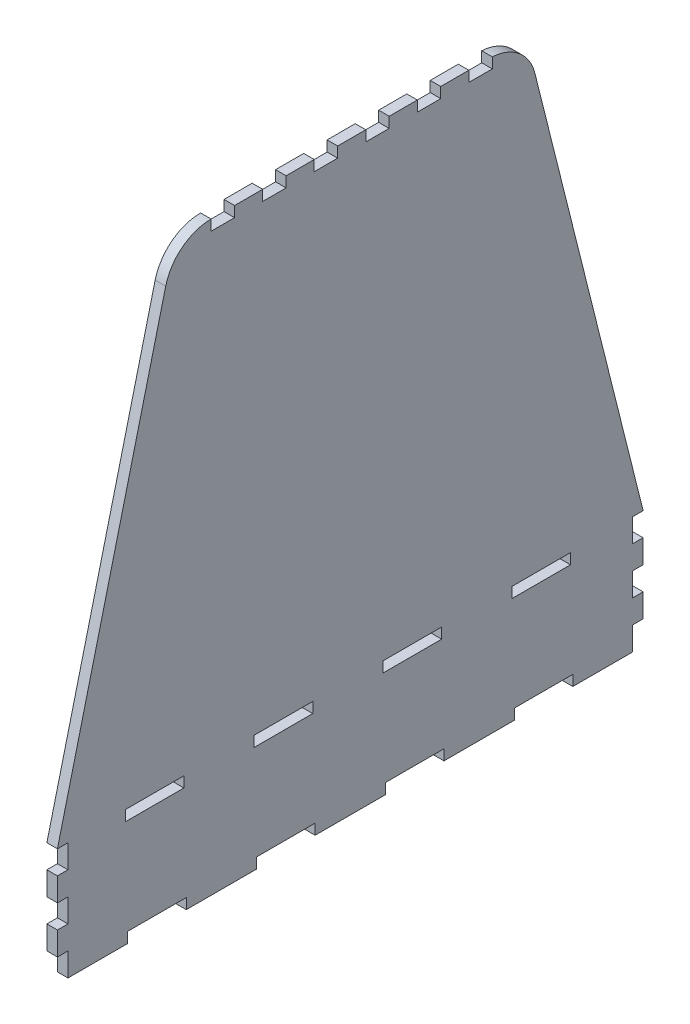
ISO-10303-21;
HEADER;
FILE_DESCRIPTION(('STEP AP214'),'2;1');
FILE_NAME('part.step','',(''),(''),'','','');
FILE_SCHEMA(('AUTOMOTIVE_DESIGN { 1 0 10303 214 1 1 1 1 }'));
ENDSEC;
DATA;
#1=APPLICATION_CONTEXT('core data for automotive mechanical design processes');
#2=APPLICATION_PROTOCOL_DEFINITION('international standard','automotive_design',2000,#1);
#3=PRODUCT_CONTEXT('',#1,'mechanical');
#4=PRODUCT('Part','Part','',(#3));
#5=PRODUCT_RELATED_PRODUCT_CATEGORY('part','',(#4));
#6=PRODUCT_DEFINITION_FORMATION('','',#4);
#7=PRODUCT_DEFINITION_CONTEXT('part definition',#1,'design');
#8=PRODUCT_DEFINITION('design','',#6,#7);
#9=PRODUCT_DEFINITION_SHAPE('','',#8);
#10=(LENGTH_UNIT() NAMED_UNIT(*) SI_UNIT(.MILLI.,.METRE.));
#11=(NAMED_UNIT(*) PLANE_ANGLE_UNIT() SI_UNIT($,.RADIAN.));
#12=(NAMED_UNIT(*) SI_UNIT($,.STERADIAN.) SOLID_ANGLE_UNIT());
#13=UNCERTAINTY_MEASURE_WITH_UNIT(LENGTH_MEASURE(1.E-05),#10,'distance_accuracy_value','');
#14=(GEOMETRIC_REPRESENTATION_CONTEXT(3) GLOBAL_UNCERTAINTY_ASSIGNED_CONTEXT((#13)) GLOBAL_UNIT_ASSIGNED_CONTEXT((#10,
#11,#12)) REPRESENTATION_CONTEXT('',''));
#15=CARTESIAN_POINT('',(0.,0.,0.));
#16=DIRECTION('',(0.,0.,1.));
#17=DIRECTION('',(1.,0.,0.));
#18=AXIS2_PLACEMENT_3D('',#15,#16,#17);
#19=CARTESIAN_POINT('',(9.,-256.437768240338,250.));
#20=DIRECTION('',(0.,0.,-1.));
#21=DIRECTION('',(-1.,0.,0.));
#22=AXIS2_PLACEMENT_3D('',#19,#20,#21);
#23=PLANE('',#22);
#24=DIRECTION('',(0.,-1.,0.));
#25=VECTOR('',#24,1.);
#26=CARTESIAN_POINT('',(0.,-256.437768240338,250.));
#27=LINE('',#26,#25);
#28=CARTESIAN_POINT('',(0.,-276.437768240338,250.));
#29=VERTEX_POINT('',#28);
#30=CARTESIAN_POINT('',(0.,-296.437768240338,250.));
#31=VERTEX_POINT('',#30);
#32=EDGE_CURVE('E659',#29,#31,#27,.T.);
#33=ORIENTED_EDGE('',*,*,#32,.T.);
#34=DIRECTION('',(1.,0.,0.));
#35=VECTOR('',#34,1.);
#36=CARTESIAN_POINT('',(0.,-296.437768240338,250.));
#37=LINE('',#36,#35);
#38=CARTESIAN_POINT('',(9.,-296.437768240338,250.));
#39=VERTEX_POINT('',#38);
#40=EDGE_CURVE('E758',#31,#39,#37,.T.);
#41=ORIENTED_EDGE('',*,*,#40,.T.);
#42=DIRECTION('',(0.,-1.,0.));
#43=VECTOR('',#42,1.);
#44=CARTESIAN_POINT('',(9.,-256.437768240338,250.));
#45=LINE('',#44,#43);
#46=CARTESIAN_POINT('',(9.,-276.437768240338,250.));
#47=VERTEX_POINT('',#46);
#48=EDGE_CURVE('E679',#47,#39,#45,.T.);
#49=ORIENTED_EDGE('',*,*,#48,.F.);
#50=DIRECTION('',(1.,0.,0.));
#51=VECTOR('',#50,1.);
#52=CARTESIAN_POINT('',(0.,-276.437768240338,250.));
#53=LINE('',#52,#51);
#54=EDGE_CURVE('E836',#29,#47,#53,.T.);
#55=ORIENTED_EDGE('',*,*,#54,.F.);
#56=EDGE_LOOP('',(#33,#41,#49,#55));
#57=FACE_BOUND('',#56,.T.);
#58=ADVANCED_FACE('F39',(#57),#23,.F.);
#59=CARTESIAN_POINT('',(9.,-256.437768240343,-250.));
#60=DIRECTION('',(0.,0.,1.));
#61=DIRECTION('',(1.,0.,0.));
#62=AXIS2_PLACEMENT_3D('',#59,#60,#61);
#63=PLANE('',#62);
#64=DIRECTION('',(0.,1.,0.));
#65=VECTOR('',#64,1.);
#66=CARTESIAN_POINT('',(9.,-256.437768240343,-250.));
#67=LINE('',#66,#65);
#68=CARTESIAN_POINT('',(9.,-336.437768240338,-249.999999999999));
#69=VERTEX_POINT('',#68);
#70=CARTESIAN_POINT('',(9.,-316.437768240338,-250.));
#71=VERTEX_POINT('',#70);
#72=EDGE_CURVE('E647',#69,#71,#67,.T.);
#73=ORIENTED_EDGE('',*,*,#72,.F.);
#74=DIRECTION('',(1.,0.,0.));
#75=VECTOR('',#74,1.);
#76=CARTESIAN_POINT('',(0.,-336.437768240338,-249.999999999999));
#77=LINE('',#76,#75);
#78=CARTESIAN_POINT('',(0.,-336.437768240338,-249.999999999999));
#79=VERTEX_POINT('',#78);
#80=EDGE_CURVE('E701',#79,#69,#77,.T.);
#81=ORIENTED_EDGE('',*,*,#80,.F.);
#82=DIRECTION('',(0.,1.,0.));
#83=VECTOR('',#82,1.);
#84=CARTESIAN_POINT('',(0.,-256.437768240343,-250.));
#85=LINE('',#84,#83);
#86=CARTESIAN_POINT('',(0.,-316.437768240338,-250.));
#87=VERTEX_POINT('',#86);
#88=EDGE_CURVE('E567',#79,#87,#85,.T.);
#89=ORIENTED_EDGE('',*,*,#88,.T.);
#90=DIRECTION('',(1.,0.,0.));
#91=VECTOR('',#90,1.);
#92=CARTESIAN_POINT('',(0.,-316.437768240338,-250.));
#93=LINE('',#92,#91);
#94=EDGE_CURVE('E703',#87,#71,#93,.T.);
#95=ORIENTED_EDGE('',*,*,#94,.T.);
#96=EDGE_LOOP('',(#73,#81,#89,#95));
#97=FACE_BOUND('',#96,.T.);
#98=ADVANCED_FACE('F700',(#97),#63,.F.);
#99=CARTESIAN_POINT('',(9.,-356.437768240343,-250.));
#100=DIRECTION('',(0.,1.,0.));
#101=DIRECTION('',(0.,0.,1.));
#102=AXIS2_PLACEMENT_3D('',#99,#100,#101);
#103=PLANE('',#102);
#104=DIRECTION('',(0.,0.,-1.));
#105=VECTOR('',#104,1.);
#106=CARTESIAN_POINT('',(9.,-356.437768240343,-250.));
#107=LINE('',#106,#105);
#108=CARTESIAN_POINT('',(9.,-356.437768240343,140.));
#109=VERTEX_POINT('',#108);
#110=CARTESIAN_POINT('',(9.,-356.437768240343,80.0000000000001));
#111=VERTEX_POINT('',#110);
#112=EDGE_CURVE('E682',#109,#111,#107,.T.);
#113=ORIENTED_EDGE('',*,*,#112,.F.);
#114=DIRECTION('',(-1.,0.,0.));
#115=VECTOR('',#114,1.);
#116=CARTESIAN_POINT('',(9.,-356.437768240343,140.));
#117=LINE('',#116,#115);
#118=CARTESIAN_POINT('',(0.,-356.437768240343,140.));
#119=VERTEX_POINT('',#118);
#120=EDGE_CURVE('E1126',#109,#119,#117,.T.);
#121=ORIENTED_EDGE('',*,*,#120,.T.);
#122=DIRECTION('',(0.,0.,-1.));
#123=VECTOR('',#122,1.);
#124=CARTESIAN_POINT('',(0.,-356.437768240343,-250.));
#125=LINE('',#124,#123);
#126=CARTESIAN_POINT('',(0.,-356.437768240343,80.0000000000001));
#127=VERTEX_POINT('',#126);
#128=EDGE_CURVE('E574',#119,#127,#125,.T.);
#129=ORIENTED_EDGE('',*,*,#128,.T.);
#130=DIRECTION('',(-1.,0.,0.));
#131=VECTOR('',#130,1.);
#132=CARTESIAN_POINT('',(9.,-356.437768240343,80.0000000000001));
#133=LINE('',#132,#131);
#134=EDGE_CURVE('E1244',#111,#127,#133,.T.);
#135=ORIENTED_EDGE('',*,*,#134,.F.);
#136=EDGE_LOOP('',(#113,#121,#129,#135));
#137=FACE_BOUND('',#136,.T.);
#138=ADVANCED_FACE('F1403',(#137),#103,.F.);
#139=CARTESIAN_POINT('',(9.,-356.437768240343,-80.));
#140=VERTEX_POINT('',#139);
#141=CARTESIAN_POINT('',(9.,-356.437768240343,-140.));
#142=VERTEX_POINT('',#141);
#143=EDGE_CURVE('E1418',#140,#142,#107,.T.);
#144=ORIENTED_EDGE('',*,*,#143,.F.);
#145=DIRECTION('',(-1.,0.,0.));
#146=VECTOR('',#145,1.);
#147=CARTESIAN_POINT('',(9.,-356.437768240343,-80.));
#148=LINE('',#147,#146);
#149=CARTESIAN_POINT('',(0.,-356.437768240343,-80.));
#150=VERTEX_POINT('',#149);
#151=EDGE_CURVE('E1287',#140,#150,#148,.T.);
#152=ORIENTED_EDGE('',*,*,#151,.T.);
#153=CARTESIAN_POINT('',(0.,-356.437768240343,-140.));
#154=VERTEX_POINT('',#153);
#155=EDGE_CURVE('E1386',#150,#154,#125,.T.);
#156=ORIENTED_EDGE('',*,*,#155,.T.);
#157=DIRECTION('',(-1.,0.,0.));
#158=VECTOR('',#157,1.);
#159=CARTESIAN_POINT('',(9.,-356.437768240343,-140.));
#160=LINE('',#159,#158);
#161=EDGE_CURVE('E1368',#142,#154,#160,.T.);
#162=ORIENTED_EDGE('',*,*,#161,.F.);
#163=EDGE_LOOP('',(#144,#152,#156,#162));
#164=FACE_BOUND('',#163,.T.);
#165=ADVANCED_FACE('F2202',(#164),#103,.F.);
#166=CARTESIAN_POINT('',(0.,-356.437768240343,30.0000000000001));
#167=VERTEX_POINT('',#166);
#168=CARTESIAN_POINT('',(0.,-356.437768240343,-30.));
#169=VERTEX_POINT('',#168);
#170=EDGE_CURVE('E1389',#167,#169,#125,.T.);
#171=ORIENTED_EDGE('',*,*,#170,.T.);
#172=DIRECTION('',(-1.,0.,0.));
#173=VECTOR('',#172,1.);
#174=CARTESIAN_POINT('',(9.,-356.437768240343,-30.));
#175=LINE('',#174,#173);
#176=CARTESIAN_POINT('',(9.,-356.437768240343,-30.));
#177=VERTEX_POINT('',#176);
#178=EDGE_CURVE('E1324',#177,#169,#175,.T.);
#179=ORIENTED_EDGE('',*,*,#178,.F.);
#180=CARTESIAN_POINT('',(9.,-356.437768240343,30.0000000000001));
#181=VERTEX_POINT('',#180);
#182=EDGE_CURVE('E1415',#181,#177,#107,.T.);
#183=ORIENTED_EDGE('',*,*,#182,.F.);
#184=DIRECTION('',(-1.,0.,0.));
#185=VECTOR('',#184,1.);
#186=CARTESIAN_POINT('',(9.,-356.437768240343,30.0000000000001));
#187=LINE('',#186,#185);
#188=EDGE_CURVE('E1207',#181,#167,#187,.T.);
#189=ORIENTED_EDGE('',*,*,#188,.T.);
#190=EDGE_LOOP('',(#171,#179,#183,#189));
#191=FACE_BOUND('',#190,.T.);
#192=ADVANCED_FACE('F1498',(#191),#103,.F.);
#193=CARTESIAN_POINT('',(0.,-356.437768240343,-190.));
#194=VERTEX_POINT('',#193);
#195=CARTESIAN_POINT('',(0.,-356.437768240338,-240.999999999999));
#196=VERTEX_POINT('',#195);
#197=EDGE_CURVE('E576',#194,#196,#125,.T.);
#198=ORIENTED_EDGE('',*,*,#197,.T.);
#199=DIRECTION('',(1.,0.,0.));
#200=VECTOR('',#199,1.);
#201=CARTESIAN_POINT('',(0.,-356.437768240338,-240.999999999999));
#202=LINE('',#201,#200);
#203=CARTESIAN_POINT('',(9.,-356.437768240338,-240.999999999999));
#204=VERTEX_POINT('',#203);
#205=EDGE_CURVE('E794',#196,#204,#202,.T.);
#206=ORIENTED_EDGE('',*,*,#205,.T.);
#207=CARTESIAN_POINT('',(9.,-356.437768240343,-190.));
#208=VERTEX_POINT('',#207);
#209=EDGE_CURVE('E683',#208,#204,#107,.T.);
#210=ORIENTED_EDGE('',*,*,#209,.F.);
#211=DIRECTION('',(-1.,0.,0.));
#212=VECTOR('',#211,1.);
#213=CARTESIAN_POINT('',(9.,-356.437768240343,-190.));
#214=LINE('',#213,#212);
#215=EDGE_CURVE('E674',#208,#194,#214,.T.);
#216=ORIENTED_EDGE('',*,*,#215,.T.);
#217=EDGE_LOOP('',(#198,#206,#210,#216));
#218=FACE_BOUND('',#217,.T.);
#219=ADVANCED_FACE('F1379',(#218),#103,.F.);
#220=CARTESIAN_POINT('',(9.,143.562231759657,-118.768943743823));
#221=DIRECTION('',(0.,-1.,0.));
#222=DIRECTION('',(0.,0.,-1.));
#223=AXIS2_PLACEMENT_3D('',#220,#221,#222);
#224=PLANE('',#223);
#225=DIRECTION('',(0.,0.,1.));
#226=VECTOR('',#225,1.);
#227=CARTESIAN_POINT('',(0.,143.562231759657,-118.768943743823));
#228=LINE('',#227,#226);
#229=CARTESIAN_POINT('',(0.,143.562231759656,74.7689437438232));
#230=VERTEX_POINT('',#229);
#231=CARTESIAN_POINT('',(0.,143.562231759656,98.7689437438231));
#232=VERTEX_POINT('',#231);
#233=EDGE_CURVE('E585',#230,#232,#228,.T.);
#234=ORIENTED_EDGE('',*,*,#233,.T.);
#235=DIRECTION('',(-1.,0.,0.));
#236=VECTOR('',#235,1.);
#237=CARTESIAN_POINT('',(9.,143.562231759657,98.7689437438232));
#238=LINE('',#237,#236);
#239=CARTESIAN_POINT('',(9.,143.562231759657,98.7689437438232));
#240=VERTEX_POINT('',#239);
#241=EDGE_CURVE('E1087',#240,#232,#238,.T.);
#242=ORIENTED_EDGE('',*,*,#241,.F.);
#243=DIRECTION('',(0.,0.,1.));
#244=VECTOR('',#243,1.);
#245=CARTESIAN_POINT('',(9.,143.562231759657,-118.768943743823));
#246=LINE('',#245,#244);
#247=CARTESIAN_POINT('',(9.,143.562231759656,74.7689437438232));
#248=VERTEX_POINT('',#247);
#249=EDGE_CURVE('E639',#248,#240,#246,.T.);
#250=ORIENTED_EDGE('',*,*,#249,.F.);
#251=DIRECTION('',(-1.,0.,0.));
#252=VECTOR('',#251,1.);
#253=CARTESIAN_POINT('',(9.,143.562231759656,74.7689437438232));
#254=LINE('',#253,#252);
#255=EDGE_CURVE('E880',#248,#230,#254,.T.);
#256=ORIENTED_EDGE('',*,*,#255,.T.);
#257=EDGE_LOOP('',(#234,#242,#250,#256));
#258=FACE_BOUND('',#257,.T.);
#259=ADVANCED_FACE('F1483',(#258),#224,.F.);
#260=CARTESIAN_POINT('',(0.,143.562231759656,30.7689437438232));
#261=VERTEX_POINT('',#260);
#262=CARTESIAN_POINT('',(0.,143.562231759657,54.7689437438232));
#263=VERTEX_POINT('',#262);
#264=EDGE_CURVE('E589',#261,#263,#228,.T.);
#265=ORIENTED_EDGE('',*,*,#264,.T.);
#266=DIRECTION('',(-1.,0.,0.));
#267=VECTOR('',#266,1.);
#268=CARTESIAN_POINT('',(9.,143.562231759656,54.7689437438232));
#269=LINE('',#268,#267);
#270=CARTESIAN_POINT('',(9.,143.562231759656,54.7689437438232));
#271=VERTEX_POINT('',#270);
#272=EDGE_CURVE('E868',#271,#263,#269,.T.);
#273=ORIENTED_EDGE('',*,*,#272,.F.);
#274=CARTESIAN_POINT('',(9.,143.562231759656,30.7689437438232));
#275=VERTEX_POINT('',#274);
#276=EDGE_CURVE('E644',#275,#271,#246,.T.);
#277=ORIENTED_EDGE('',*,*,#276,.F.);
#278=DIRECTION('',(-1.,0.,0.));
#279=VECTOR('',#278,1.);
#280=CARTESIAN_POINT('',(9.,143.562231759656,30.7689437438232));
#281=LINE('',#280,#279);
#282=EDGE_CURVE('E874',#275,#261,#281,.T.);
#283=ORIENTED_EDGE('',*,*,#282,.T.);
#284=EDGE_LOOP('',(#265,#273,#277,#283));
#285=FACE_BOUND('',#284,.T.);
#286=ADVANCED_FACE('F1475',(#285),#224,.F.);
#287=CARTESIAN_POINT('',(0.,143.562231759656,-13.2310562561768));
#288=VERTEX_POINT('',#287);
#289=CARTESIAN_POINT('',(0.,143.562231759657,10.7689437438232));
#290=VERTEX_POINT('',#289);
#291=EDGE_CURVE('E1525',#288,#290,#228,.T.);
#292=ORIENTED_EDGE('',*,*,#291,.T.);
#293=DIRECTION('',(-1.,0.,0.));
#294=VECTOR('',#293,1.);
#295=CARTESIAN_POINT('',(9.,143.562231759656,10.7689437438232));
#296=LINE('',#295,#294);
#297=CARTESIAN_POINT('',(9.,143.562231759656,10.7689437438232));
#298=VERTEX_POINT('',#297);
#299=EDGE_CURVE('E906',#298,#290,#296,.T.);
#300=ORIENTED_EDGE('',*,*,#299,.F.);
#301=CARTESIAN_POINT('',(9.,143.562231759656,-13.2310562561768));
#302=VERTEX_POINT('',#301);
#303=EDGE_CURVE('E1551',#302,#298,#246,.T.);
#304=ORIENTED_EDGE('',*,*,#303,.F.);
#305=DIRECTION('',(-1.,0.,0.));
#306=VECTOR('',#305,1.);
#307=CARTESIAN_POINT('',(9.,143.562231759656,-13.2310562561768));
#308=LINE('',#307,#306);
#309=EDGE_CURVE('E912',#302,#288,#308,.T.);
#310=ORIENTED_EDGE('',*,*,#309,.T.);
#311=EDGE_LOOP('',(#292,#300,#304,#310));
#312=FACE_BOUND('',#311,.T.);
#313=ADVANCED_FACE('F1468',(#312),#224,.F.);
#314=CARTESIAN_POINT('',(0.,143.562231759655,-57.2310562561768));
#315=VERTEX_POINT('',#314);
#316=CARTESIAN_POINT('',(0.,143.562231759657,-33.2310562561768));
#317=VERTEX_POINT('',#316);
#318=EDGE_CURVE('E1528',#315,#317,#228,.T.);
#319=ORIENTED_EDGE('',*,*,#318,.T.);
#320=DIRECTION('',(-1.,0.,0.));
#321=VECTOR('',#320,1.);
#322=CARTESIAN_POINT('',(9.,143.562231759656,-33.2310562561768));
#323=LINE('',#322,#321);
#324=CARTESIAN_POINT('',(9.,143.562231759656,-33.2310562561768));
#325=VERTEX_POINT('',#324);
#326=EDGE_CURVE('E942',#325,#317,#323,.T.);
#327=ORIENTED_EDGE('',*,*,#326,.F.);
#328=CARTESIAN_POINT('',(9.,143.562231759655,-57.2310562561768));
#329=VERTEX_POINT('',#328);
#330=EDGE_CURVE('E1548',#329,#325,#246,.T.);
#331=ORIENTED_EDGE('',*,*,#330,.F.);
#332=DIRECTION('',(-1.,0.,0.));
#333=VECTOR('',#332,1.);
#334=CARTESIAN_POINT('',(9.,143.562231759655,-57.2310562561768));
#335=LINE('',#334,#333);
#336=EDGE_CURVE('E948',#329,#315,#335,.T.);
#337=ORIENTED_EDGE('',*,*,#336,.T.);
#338=EDGE_LOOP('',(#319,#327,#331,#337));
#339=FACE_BOUND('',#338,.T.);
#340=ADVANCED_FACE('F1462',(#339),#224,.F.);
#341=CARTESIAN_POINT('',(9.,-316.437768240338,250.));
#342=VERTEX_POINT('',#341);
#343=CARTESIAN_POINT('',(9.,-336.437768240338,249.999999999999));
#344=VERTEX_POINT('',#343);
#345=EDGE_CURVE('E598',#342,#344,#45,.T.);
#346=ORIENTED_EDGE('',*,*,#345,.F.);
#347=DIRECTION('',(1.,0.,0.));
#348=VECTOR('',#347,1.);
#349=CARTESIAN_POINT('',(0.,-316.437768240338,250.));
#350=LINE('',#349,#348);
#351=CARTESIAN_POINT('',(0.,-316.437768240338,250.));
#352=VERTEX_POINT('',#351);
#353=EDGE_CURVE('E775',#352,#342,#350,.T.);
#354=ORIENTED_EDGE('',*,*,#353,.F.);
#355=CARTESIAN_POINT('',(0.,-336.437768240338,249.999999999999));
#356=VERTEX_POINT('',#355);
#357=EDGE_CURVE('E656',#352,#356,#27,.T.);
#358=ORIENTED_EDGE('',*,*,#357,.T.);
#359=DIRECTION('',(1.,0.,0.));
#360=VECTOR('',#359,1.);
#361=CARTESIAN_POINT('',(0.,-336.437768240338,249.999999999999));
#362=LINE('',#361,#360);
#363=EDGE_CURVE('E790',#356,#344,#362,.T.);
#364=ORIENTED_EDGE('',*,*,#363,.T.);
#365=EDGE_LOOP('',(#346,#354,#358,#364));
#366=FACE_BOUND('',#365,.T.);
#367=ADVANCED_FACE('F41',(#366),#23,.F.);
#368=CARTESIAN_POINT('',(9.,-356.437768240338,240.999999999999));
#369=VERTEX_POINT('',#368);
#370=CARTESIAN_POINT('',(9.,-356.437768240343,190.));
#371=VERTEX_POINT('',#370);
#372=EDGE_CURVE('E680',#369,#371,#107,.T.);
#373=ORIENTED_EDGE('',*,*,#372,.F.);
#374=DIRECTION('',(1.,0.,0.));
#375=VECTOR('',#374,1.);
#376=CARTESIAN_POINT('',(0.,-356.437768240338,240.999999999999));
#377=LINE('',#376,#375);
#378=CARTESIAN_POINT('',(0.,-356.437768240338,240.999999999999));
#379=VERTEX_POINT('',#378);
#380=EDGE_CURVE('E800',#379,#369,#377,.T.);
#381=ORIENTED_EDGE('',*,*,#380,.F.);
#382=CARTESIAN_POINT('',(0.,-356.437768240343,190.));
#383=VERTEX_POINT('',#382);
#384=EDGE_CURVE('E568',#379,#383,#125,.T.);
#385=ORIENTED_EDGE('',*,*,#384,.T.);
#386=DIRECTION('',(-1.,0.,0.));
#387=VECTOR('',#386,1.);
#388=CARTESIAN_POINT('',(9.,-356.437768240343,190.));
#389=LINE('',#388,#387);
#390=EDGE_CURVE('E1163',#371,#383,#389,.T.);
#391=ORIENTED_EDGE('',*,*,#390,.F.);
#392=EDGE_LOOP('',(#373,#381,#385,#391));
#393=FACE_BOUND('',#392,.T.);
#394=ADVANCED_FACE('F1461',(#393),#103,.F.);
#395=CARTESIAN_POINT('',(0.,-296.437768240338,-250.));
#396=VERTEX_POINT('',#395);
#397=CARTESIAN_POINT('',(0.,-276.437768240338,-250.));
#398=VERTEX_POINT('',#397);
#399=EDGE_CURVE('E556',#396,#398,#85,.T.);
#400=ORIENTED_EDGE('',*,*,#399,.T.);
#401=DIRECTION('',(1.,0.,0.));
#402=VECTOR('',#401,1.);
#403=CARTESIAN_POINT('',(0.,-276.437768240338,-250.));
#404=LINE('',#403,#402);
#405=CARTESIAN_POINT('',(9.,-276.437768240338,-250.));
#406=VERTEX_POINT('',#405);
#407=EDGE_CURVE('E738',#398,#406,#404,.T.);
#408=ORIENTED_EDGE('',*,*,#407,.T.);
#409=CARTESIAN_POINT('',(9.,-296.437768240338,-250.));
#410=VERTEX_POINT('',#409);
#411=EDGE_CURVE('E558',#410,#406,#67,.T.);
#412=ORIENTED_EDGE('',*,*,#411,.F.);
#413=DIRECTION('',(1.,0.,0.));
#414=VECTOR('',#413,1.);
#415=CARTESIAN_POINT('',(0.,-296.437768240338,-250.));
#416=LINE('',#415,#414);
#417=EDGE_CURVE('E541',#396,#410,#416,.T.);
#418=ORIENTED_EDGE('',*,*,#417,.F.);
#419=EDGE_LOOP('',(#400,#408,#412,#418));
#420=FACE_BOUND('',#419,.T.);
#421=ADVANCED_FACE('F554',(#420),#63,.F.);
#422=CARTESIAN_POINT('',(9.,-256.437768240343,-250.));
#423=DIRECTION('',(0.,-0.242535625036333,0.970142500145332));
#424=DIRECTION('',(0.,-0.970142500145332,-0.242535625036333));
#425=AXIS2_PLACEMENT_3D('',#422,#423,#424);
#426=PLANE('',#425);
#427=DIRECTION('',(0.,0.970142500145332,0.242535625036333));
#428=VECTOR('',#427,1.);
#429=CARTESIAN_POINT('',(0.,-256.437768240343,-250.));
#430=LINE('',#429,#428);
#431=CARTESIAN_POINT('',(0.,-256.437768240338,-250.));
#432=VERTEX_POINT('',#431);
#433=CARTESIAN_POINT('',(0.,113.26365676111,-157.574643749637));
#434=VERTEX_POINT('',#433);
#435=EDGE_CURVE('E573',#432,#434,#430,.T.);
#436=ORIENTED_EDGE('',*,*,#435,.T.);
#437=DIRECTION('',(-1.,0.,0.));
#438=VECTOR('',#437,1.);
#439=CARTESIAN_POINT('',(9.,113.26365676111,-157.574643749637));
#440=LINE('',#439,#438);
#441=CARTESIAN_POINT('',(9.,113.26365676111,-157.574643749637));
#442=VERTEX_POINT('',#441);
#443=EDGE_CURVE('E611',#442,#434,#440,.T.);
#444=ORIENTED_EDGE('',*,*,#443,.F.);
#445=DIRECTION('',(0.,0.970142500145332,0.242535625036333));
#446=VECTOR('',#445,1.);
#447=CARTESIAN_POINT('',(9.,-256.437768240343,-250.));
#448=LINE('',#447,#446);
#449=CARTESIAN_POINT('',(9.,-256.437768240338,-250.));
#450=VERTEX_POINT('',#449);
#451=EDGE_CURVE('E621',#450,#442,#448,.T.);
#452=ORIENTED_EDGE('',*,*,#451,.F.);
#453=DIRECTION('',(-1.,0.,0.));
#454=VECTOR('',#453,1.);
#455=CARTESIAN_POINT('',(9.,-256.437768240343,-250.));
#456=LINE('',#455,#454);
#457=EDGE_CURVE('E48',#450,#432,#456,.T.);
#458=ORIENTED_EDGE('',*,*,#457,.T.);
#459=EDGE_LOOP('',(#436,#444,#452,#458));
#460=FACE_BOUND('',#459,.T.);
#461=ADVANCED_FACE('F619',(#460),#426,.F.);
#462=CARTESIAN_POINT('',(9.,103.562231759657,-118.768943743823));
#463=DIRECTION('',(-1.,0.,0.));
#464=DIRECTION('',(0.,0.,1.));
#465=AXIS2_PLACEMENT_3D('',#462,#463,#464);
#466=CYLINDRICAL_SURFACE('',#465,40.);
#467=CARTESIAN_POINT('',(0.,103.562231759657,-118.768943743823));
#468=DIRECTION('',(1.,0.,0.));
#469=DIRECTION('',(0.,0.,-1.));
#470=AXIS2_PLACEMENT_3D('',#467,#468,#469);
#471=CIRCLE('',#470,40.);
#472=CARTESIAN_POINT('',(0.,143.486384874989,-121.231056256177));
#473=VERTEX_POINT('',#472);
#474=EDGE_CURVE('E581',#434,#473,#471,.T.);
#475=ORIENTED_EDGE('',*,*,#474,.T.);
#476=DIRECTION('',(-1.,0.,0.));
#477=VECTOR('',#476,1.);
#478=CARTESIAN_POINT('',(9.,143.486384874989,-121.231056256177));
#479=LINE('',#478,#477);
#480=CARTESIAN_POINT('',(9.,143.486384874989,-121.231056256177));
#481=VERTEX_POINT('',#480);
#482=EDGE_CURVE('E633',#473,#481,#479,.F.);
#483=ORIENTED_EDGE('',*,*,#482,.T.);
#484=CARTESIAN_POINT('',(9.,103.562231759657,-118.768943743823));
#485=DIRECTION('',(1.,0.,0.));
#486=DIRECTION('',(0.,0.,-1.));
#487=AXIS2_PLACEMENT_3D('',#484,#485,#486);
#488=CIRCLE('',#487,40.);
#489=EDGE_CURVE('E635',#442,#481,#488,.T.);
#490=ORIENTED_EDGE('',*,*,#489,.F.);
#491=ORIENTED_EDGE('',*,*,#443,.T.);
#492=EDGE_LOOP('',(#475,#483,#490,#491));
#493=FACE_BOUND('',#492,.T.);
#494=ADVANCED_FACE('F631',(#493),#466,.T.);
#495=CARTESIAN_POINT('',(0.,143.562231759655,-101.231056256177));
#496=VERTEX_POINT('',#495);
#497=CARTESIAN_POINT('',(0.,143.562231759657,-77.2310562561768));
#498=VERTEX_POINT('',#497);
#499=EDGE_CURVE('E590',#496,#498,#228,.T.);
#500=ORIENTED_EDGE('',*,*,#499,.T.);
#501=DIRECTION('',(-1.,0.,0.));
#502=VECTOR('',#501,1.);
#503=CARTESIAN_POINT('',(9.,143.562231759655,-77.2310562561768));
#504=LINE('',#503,#502);
#505=CARTESIAN_POINT('',(9.,143.562231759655,-77.2310562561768));
#506=VERTEX_POINT('',#505);
#507=EDGE_CURVE('E978',#506,#498,#504,.T.);
#508=ORIENTED_EDGE('',*,*,#507,.F.);
#509=CARTESIAN_POINT('',(9.,143.562231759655,-101.231056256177));
#510=VERTEX_POINT('',#509);
#511=EDGE_CURVE('E646',#510,#506,#246,.T.);
#512=ORIENTED_EDGE('',*,*,#511,.F.);
#513=DIRECTION('',(-1.,0.,0.));
#514=VECTOR('',#513,1.);
#515=CARTESIAN_POINT('',(9.,143.562231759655,-101.231056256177));
#516=LINE('',#515,#514);
#517=EDGE_CURVE('E984',#510,#496,#516,.T.);
#518=ORIENTED_EDGE('',*,*,#517,.T.);
#519=EDGE_LOOP('',(#500,#508,#512,#518));
#520=FACE_BOUND('',#519,.T.);
#521=ADVANCED_FACE('F1471',(#520),#224,.F.);
#522=CARTESIAN_POINT('',(9.,103.562231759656,118.768943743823));
#523=DIRECTION('',(-1.,0.,0.));
#524=DIRECTION('',(0.,0.,1.));
#525=AXIS2_PLACEMENT_3D('',#522,#523,#524);
#526=CYLINDRICAL_SURFACE('',#525,40.);
#527=CARTESIAN_POINT('',(0.,103.562231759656,118.768943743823));
#528=DIRECTION('',(1.,0.,0.));
#529=DIRECTION('',(0.,0.,-1.));
#530=AXIS2_PLACEMENT_3D('',#527,#528,#529);
#531=CIRCLE('',#530,40.);
#532=CARTESIAN_POINT('',(0.,143.562231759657,118.768943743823));
#533=VERTEX_POINT('',#532);
#534=CARTESIAN_POINT('',(0.,113.26365676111,157.574643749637));
#535=VERTEX_POINT('',#534);
#536=EDGE_CURVE('E591',#533,#535,#531,.T.);
#537=ORIENTED_EDGE('',*,*,#536,.T.);
#538=DIRECTION('',(-1.,0.,0.));
#539=VECTOR('',#538,1.);
#540=CARTESIAN_POINT('',(9.,113.26365676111,157.574643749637));
#541=LINE('',#540,#539);
#542=CARTESIAN_POINT('',(9.,113.26365676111,157.574643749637));
#543=VERTEX_POINT('',#542);
#544=EDGE_CURVE('E602',#543,#535,#541,.T.);
#545=ORIENTED_EDGE('',*,*,#544,.F.);
#546=CARTESIAN_POINT('',(9.,103.562231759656,118.768943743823));
#547=DIRECTION('',(1.,0.,0.));
#548=DIRECTION('',(0.,0.,-1.));
#549=AXIS2_PLACEMENT_3D('',#546,#547,#548);
#550=CIRCLE('',#549,40.);
#551=CARTESIAN_POINT('',(9.,143.562231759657,118.768943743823));
#552=VERTEX_POINT('',#551);
#553=EDGE_CURVE('E651',#552,#543,#550,.T.);
#554=ORIENTED_EDGE('',*,*,#553,.F.);
#555=DIRECTION('',(-1.,0.,0.));
#556=VECTOR('',#555,1.);
#557=CARTESIAN_POINT('',(9.,143.562231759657,118.768943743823));
#558=LINE('',#557,#556);
#559=EDGE_CURVE('E607',#552,#533,#558,.T.);
#560=ORIENTED_EDGE('',*,*,#559,.T.);
#561=EDGE_LOOP('',(#537,#545,#554,#560));
#562=FACE_BOUND('',#561,.T.);
#563=ADVANCED_FACE('F1481',(#562),#526,.T.);
#564=CARTESIAN_POINT('',(9.,113.26365676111,157.574643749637));
#565=DIRECTION('',(0.,-0.242535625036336,-0.970142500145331));
#566=DIRECTION('',(0.,0.970142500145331,-0.242535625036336));
#567=AXIS2_PLACEMENT_3D('',#564,#565,#566);
#568=PLANE('',#567);
#569=DIRECTION('',(0.,-0.970142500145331,0.242535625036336));
#570=VECTOR('',#569,1.);
#571=CARTESIAN_POINT('',(0.,113.26365676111,157.574643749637));
#572=LINE('',#571,#570);
#573=CARTESIAN_POINT('',(0.,-256.437768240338,250.));
#574=VERTEX_POINT('',#573);
#575=EDGE_CURVE('E594',#535,#574,#572,.T.);
#576=ORIENTED_EDGE('',*,*,#575,.T.);
#577=DIRECTION('',(-1.,0.,0.));
#578=VECTOR('',#577,1.);
#579=CARTESIAN_POINT('',(9.,-256.437768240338,250.));
#580=LINE('',#579,#578);
#581=CARTESIAN_POINT('',(9.,-256.437768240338,250.));
#582=VERTEX_POINT('',#581);
#583=EDGE_CURVE('E599',#582,#574,#580,.T.);
#584=ORIENTED_EDGE('',*,*,#583,.F.);
#585=DIRECTION('',(0.,-0.970142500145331,0.242535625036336));
#586=VECTOR('',#585,1.);
#587=CARTESIAN_POINT('',(9.,113.26365676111,157.574643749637));
#588=LINE('',#587,#586);
#589=EDGE_CURVE('E603',#543,#582,#588,.T.);
#590=ORIENTED_EDGE('',*,*,#589,.F.);
#591=ORIENTED_EDGE('',*,*,#544,.T.);
#592=EDGE_LOOP('',(#576,#584,#590,#591));
#593=FACE_BOUND('',#592,.T.);
#594=ADVANCED_FACE('F1488',(#593),#568,.F.);
#595=CARTESIAN_POINT('',(9.,103.562231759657,-118.768943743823));
#596=DIRECTION('',(1.,0.,0.));
#597=DIRECTION('',(0.,0.,-1.));
#598=AXIS2_PLACEMENT_3D('',#595,#596,#597);
#599=PLANE('',#598);
#600=DIRECTION('',(0.,0.,-1.));
#601=VECTOR('',#600,1.);
#602=CARTESIAN_POINT('',(9.,-276.437768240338,-250.));
#603=LINE('',#602,#601);
#604=CARTESIAN_POINT('',(9.,-276.437768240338,-241.));
#605=VERTEX_POINT('',#604);
#606=EDGE_CURVE('E722',#605,#406,#603,.T.);
#607=ORIENTED_EDGE('',*,*,#606,.F.);
#608=DIRECTION('',(0.,-1.,0.));
#609=VECTOR('',#608,1.);
#610=CARTESIAN_POINT('',(9.,-256.437768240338,-241.));
#611=LINE('',#610,#609);
#612=CARTESIAN_POINT('',(9.,-256.437768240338,-241.));
#613=VERTEX_POINT('',#612);
#614=EDGE_CURVE('E731',#613,#605,#611,.T.);
#615=ORIENTED_EDGE('',*,*,#614,.F.);
#616=DIRECTION('',(0.,0.,1.));
#617=VECTOR('',#616,1.);
#618=CARTESIAN_POINT('',(9.,-256.437768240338,-250.));
#619=LINE('',#618,#617);
#620=EDGE_CURVE('E728',#450,#613,#619,.T.);
#621=ORIENTED_EDGE('',*,*,#620,.F.);
#622=ORIENTED_EDGE('',*,*,#451,.T.);
#623=ORIENTED_EDGE('',*,*,#489,.T.);
#624=DIRECTION('',(0.,-1.,0.));
#625=VECTOR('',#624,1.);
#626=CARTESIAN_POINT('',(9.,143.562231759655,-121.231056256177));
#627=LINE('',#626,#625);
#628=CARTESIAN_POINT('',(9.,134.562231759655,-121.231056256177));
#629=VERTEX_POINT('',#628);
#630=EDGE_CURVE('E1001',#481,#629,#627,.T.);
#631=ORIENTED_EDGE('',*,*,#630,.T.);
#632=DIRECTION('',(0.,0.,1.));
#633=VECTOR('',#632,1.);
#634=CARTESIAN_POINT('',(9.,134.562231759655,-101.231056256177));
#635=LINE('',#634,#633);
#636=CARTESIAN_POINT('',(9.,134.562231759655,-101.231056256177));
#637=VERTEX_POINT('',#636);
#638=EDGE_CURVE('E1004',#629,#637,#635,.T.);
#639=ORIENTED_EDGE('',*,*,#638,.T.);
#640=DIRECTION('',(0.,1.,0.));
#641=VECTOR('',#640,1.);
#642=CARTESIAN_POINT('',(9.,143.562231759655,-101.231056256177));
#643=LINE('',#642,#641);
#644=EDGE_CURVE('E1009',#637,#510,#643,.T.);
#645=ORIENTED_EDGE('',*,*,#644,.T.);
#646=ORIENTED_EDGE('',*,*,#511,.T.);
#647=DIRECTION('',(0.,-1.,0.));
#648=VECTOR('',#647,1.);
#649=CARTESIAN_POINT('',(9.,143.562231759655,-77.2310562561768));
#650=LINE('',#649,#648);
#651=CARTESIAN_POINT('',(9.,134.562231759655,-77.2310562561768));
#652=VERTEX_POINT('',#651);
#653=EDGE_CURVE('E965',#506,#652,#650,.T.);
#654=ORIENTED_EDGE('',*,*,#653,.T.);
#655=DIRECTION('',(0.,0.,1.));
#656=VECTOR('',#655,1.);
#657=CARTESIAN_POINT('',(9.,134.562231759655,-57.2310562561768));
#658=LINE('',#657,#656);
#659=CARTESIAN_POINT('',(9.,134.562231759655,-57.2310562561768));
#660=VERTEX_POINT('',#659);
#661=EDGE_CURVE('E969',#652,#660,#658,.T.);
#662=ORIENTED_EDGE('',*,*,#661,.T.);
#663=DIRECTION('',(0.,1.,0.));
#664=VECTOR('',#663,1.);
#665=CARTESIAN_POINT('',(9.,143.562231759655,-57.2310562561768));
#666=LINE('',#665,#664);
#667=EDGE_CURVE('E974',#660,#329,#666,.T.);
#668=ORIENTED_EDGE('',*,*,#667,.T.);
#669=ORIENTED_EDGE('',*,*,#330,.T.);
#670=DIRECTION('',(0.,-1.,0.));
#671=VECTOR('',#670,1.);
#672=CARTESIAN_POINT('',(9.,143.562231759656,-33.2310562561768));
#673=LINE('',#672,#671);
#674=CARTESIAN_POINT('',(9.,134.562231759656,-33.2310562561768));
#675=VERTEX_POINT('',#674);
#676=EDGE_CURVE('E929',#325,#675,#673,.T.);
#677=ORIENTED_EDGE('',*,*,#676,.T.);
#678=DIRECTION('',(0.,0.,1.));
#679=VECTOR('',#678,1.);
#680=CARTESIAN_POINT('',(9.,134.562231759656,-13.2310562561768));
#681=LINE('',#680,#679);
#682=CARTESIAN_POINT('',(9.,134.562231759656,-13.2310562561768));
#683=VERTEX_POINT('',#682);
#684=EDGE_CURVE('E933',#675,#683,#681,.T.);
#685=ORIENTED_EDGE('',*,*,#684,.T.);
#686=DIRECTION('',(0.,1.,0.));
#687=VECTOR('',#686,1.);
#688=CARTESIAN_POINT('',(9.,143.562231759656,-13.2310562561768));
#689=LINE('',#688,#687);
#690=EDGE_CURVE('E938',#683,#302,#689,.T.);
#691=ORIENTED_EDGE('',*,*,#690,.T.);
#692=ORIENTED_EDGE('',*,*,#303,.T.);
#693=DIRECTION('',(0.,-1.,0.));
#694=VECTOR('',#693,1.);
#695=CARTESIAN_POINT('',(9.,143.562231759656,10.7689437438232));
#696=LINE('',#695,#694);
#697=CARTESIAN_POINT('',(9.,134.562231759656,10.7689437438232));
#698=VERTEX_POINT('',#697);
#699=EDGE_CURVE('E893',#298,#698,#696,.T.);
#700=ORIENTED_EDGE('',*,*,#699,.T.);
#701=DIRECTION('',(0.,0.,1.));
#702=VECTOR('',#701,1.);
#703=CARTESIAN_POINT('',(9.,134.562231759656,30.7689437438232));
#704=LINE('',#703,#702);
#705=CARTESIAN_POINT('',(9.,134.562231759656,30.7689437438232));
#706=VERTEX_POINT('',#705);
#707=EDGE_CURVE('E897',#698,#706,#704,.T.);
#708=ORIENTED_EDGE('',*,*,#707,.T.);
#709=DIRECTION('',(0.,1.,0.));
#710=VECTOR('',#709,1.);
#711=CARTESIAN_POINT('',(9.,143.562231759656,30.7689437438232));
#712=LINE('',#711,#710);
#713=EDGE_CURVE('E902',#706,#275,#712,.T.);
#714=ORIENTED_EDGE('',*,*,#713,.T.);
#715=ORIENTED_EDGE('',*,*,#276,.T.);
#716=DIRECTION('',(0.,-1.,0.));
#717=VECTOR('',#716,1.);
#718=CARTESIAN_POINT('',(9.,143.562231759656,54.7689437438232));
#719=LINE('',#718,#717);
#720=CARTESIAN_POINT('',(9.,134.562231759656,54.7689437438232));
#721=VERTEX_POINT('',#720);
#722=EDGE_CURVE('E855',#271,#721,#719,.T.);
#723=ORIENTED_EDGE('',*,*,#722,.T.);
#724=DIRECTION('',(0.,0.,1.));
#725=VECTOR('',#724,1.);
#726=CARTESIAN_POINT('',(9.,134.562231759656,74.7689437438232));
#727=LINE('',#726,#725);
#728=CARTESIAN_POINT('',(9.,134.562231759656,74.7689437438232));
#729=VERTEX_POINT('',#728);
#730=EDGE_CURVE('E859',#721,#729,#727,.T.);
#731=ORIENTED_EDGE('',*,*,#730,.T.);
#732=DIRECTION('',(0.,1.,0.));
#733=VECTOR('',#732,1.);
#734=CARTESIAN_POINT('',(9.,143.562231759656,74.7689437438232));
#735=LINE('',#734,#733);
#736=EDGE_CURVE('E864',#729,#248,#735,.T.);
#737=ORIENTED_EDGE('',*,*,#736,.T.);
#738=ORIENTED_EDGE('',*,*,#249,.T.);
#739=DIRECTION('',(0.,-1.,0.));
#740=VECTOR('',#739,1.);
#741=CARTESIAN_POINT('',(9.,143.562231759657,98.7689437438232));
#742=LINE('',#741,#740);
#743=CARTESIAN_POINT('',(9.,134.562231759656,98.7689437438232));
#744=VERTEX_POINT('',#743);
#745=EDGE_CURVE('E1078',#240,#744,#742,.T.);
#746=ORIENTED_EDGE('',*,*,#745,.T.);
#747=DIRECTION('',(0.,0.,1.));
#748=VECTOR('',#747,1.);
#749=CARTESIAN_POINT('',(9.,134.562231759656,118.768943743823));
#750=LINE('',#749,#748);
#751=CARTESIAN_POINT('',(9.,134.562231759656,118.768943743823));
#752=VERTEX_POINT('',#751);
#753=EDGE_CURVE('E1083',#744,#752,#750,.T.);
#754=ORIENTED_EDGE('',*,*,#753,.T.);
#755=DIRECTION('',(0.,1.,0.));
#756=VECTOR('',#755,1.);
#757=CARTESIAN_POINT('',(9.,143.562231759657,118.768943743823));
#758=LINE('',#757,#756);
#759=EDGE_CURVE('E1074',#752,#552,#758,.T.);
#760=ORIENTED_EDGE('',*,*,#759,.T.);
#761=ORIENTED_EDGE('',*,*,#553,.T.);
#762=ORIENTED_EDGE('',*,*,#589,.T.);
#763=DIRECTION('',(0.,0.,1.));
#764=VECTOR('',#763,1.);
#765=CARTESIAN_POINT('',(9.,-256.437768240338,250.));
#766=LINE('',#765,#764);
#767=CARTESIAN_POINT('',(9.,-256.437768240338,241.));
#768=VERTEX_POINT('',#767);
#769=EDGE_CURVE('E828',#768,#582,#766,.T.);
#770=ORIENTED_EDGE('',*,*,#769,.F.);
#771=DIRECTION('',(0.,1.,0.));
#772=VECTOR('',#771,1.);
#773=CARTESIAN_POINT('',(9.,-256.437768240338,241.));
#774=LINE('',#773,#772);
#775=CARTESIAN_POINT('',(9.,-276.437768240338,241.));
#776=VERTEX_POINT('',#775);
#777=EDGE_CURVE('E840',#776,#768,#774,.T.);
#778=ORIENTED_EDGE('',*,*,#777,.F.);
#779=DIRECTION('',(0.,0.,-1.));
#780=VECTOR('',#779,1.);
#781=CARTESIAN_POINT('',(9.,-276.437768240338,250.));
#782=LINE('',#781,#780);
#783=EDGE_CURVE('E741',#47,#776,#782,.T.);
#784=ORIENTED_EDGE('',*,*,#783,.F.);
#785=ORIENTED_EDGE('',*,*,#48,.T.);
#786=DIRECTION('',(0.,0.,1.));
#787=VECTOR('',#786,1.);
#788=CARTESIAN_POINT('',(9.,-296.437768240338,250.));
#789=LINE('',#788,#787);
#790=CARTESIAN_POINT('',(9.,-296.437768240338,241.));
#791=VERTEX_POINT('',#790);
#792=EDGE_CURVE('E759',#791,#39,#789,.T.);
#793=ORIENTED_EDGE('',*,*,#792,.F.);
#794=DIRECTION('',(0.,1.,0.));
#795=VECTOR('',#794,1.);
#796=CARTESIAN_POINT('',(9.,-296.437768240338,241.));
#797=LINE('',#796,#795);
#798=CARTESIAN_POINT('',(9.,-316.437768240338,241.));
#799=VERTEX_POINT('',#798);
#800=EDGE_CURVE('E752',#799,#791,#797,.T.);
#801=ORIENTED_EDGE('',*,*,#800,.F.);
#802=DIRECTION('',(0.,0.,-1.));
#803=VECTOR('',#802,1.);
#804=CARTESIAN_POINT('',(9.,-316.437768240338,250.));
#805=LINE('',#804,#803);
#806=EDGE_CURVE('E762',#342,#799,#805,.T.);
#807=ORIENTED_EDGE('',*,*,#806,.F.);
#808=ORIENTED_EDGE('',*,*,#345,.T.);
#809=DIRECTION('',(0.,0.,1.));
#810=VECTOR('',#809,1.);
#811=CARTESIAN_POINT('',(9.,-336.437768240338,249.999999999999));
#812=LINE('',#811,#810);
#813=CARTESIAN_POINT('',(9.,-336.437768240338,240.999999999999));
#814=VERTEX_POINT('',#813);
#815=EDGE_CURVE('E791',#814,#344,#812,.T.);
#816=ORIENTED_EDGE('',*,*,#815,.F.);
#817=DIRECTION('',(0.,1.,0.));
#818=VECTOR('',#817,1.);
#819=CARTESIAN_POINT('',(9.,-336.437768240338,240.999999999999));
#820=LINE('',#819,#818);
#821=EDGE_CURVE('E786',#369,#814,#820,.T.);
#822=ORIENTED_EDGE('',*,*,#821,.F.);
#823=ORIENTED_EDGE('',*,*,#372,.T.);
#824=DIRECTION('',(0.,1.,0.));
#825=VECTOR('',#824,1.);
#826=CARTESIAN_POINT('',(9.,-356.437768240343,190.));
#827=LINE('',#826,#825);
#828=CARTESIAN_POINT('',(9.,-347.437768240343,190.));
#829=VERTEX_POINT('',#828);
#830=EDGE_CURVE('E1150',#371,#829,#827,.T.);
#831=ORIENTED_EDGE('',*,*,#830,.T.);
#832=DIRECTION('',(0.,0.,-1.));
#833=VECTOR('',#832,1.);
#834=CARTESIAN_POINT('',(9.,-347.437768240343,140.));
#835=LINE('',#834,#833);
#836=CARTESIAN_POINT('',(9.,-347.437768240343,140.));
#837=VERTEX_POINT('',#836);
#838=EDGE_CURVE('E1154',#829,#837,#835,.T.);
#839=ORIENTED_EDGE('',*,*,#838,.T.);
#840=DIRECTION('',(0.,-1.,0.));
#841=VECTOR('',#840,1.);
#842=CARTESIAN_POINT('',(9.,-356.437768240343,140.));
#843=LINE('',#842,#841);
#844=EDGE_CURVE('E1159',#837,#109,#843,.T.);
#845=ORIENTED_EDGE('',*,*,#844,.T.);
#846=ORIENTED_EDGE('',*,*,#112,.T.);
#847=DIRECTION('',(0.,1.,0.));
#848=VECTOR('',#847,1.);
#849=CARTESIAN_POINT('',(9.,-356.437768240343,80.0000000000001));
#850=LINE('',#849,#848);
#851=CARTESIAN_POINT('',(9.,-347.437768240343,80.0000000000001));
#852=VERTEX_POINT('',#851);
#853=EDGE_CURVE('E1231',#111,#852,#850,.T.);
#854=ORIENTED_EDGE('',*,*,#853,.T.);
#855=DIRECTION('',(0.,0.,-1.));
#856=VECTOR('',#855,1.);
#857=CARTESIAN_POINT('',(9.,-347.437768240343,30.0000000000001));
#858=LINE('',#857,#856);
#859=CARTESIAN_POINT('',(9.,-347.437768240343,30.0000000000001));
#860=VERTEX_POINT('',#859);
#861=EDGE_CURVE('E1235',#852,#860,#858,.T.);
#862=ORIENTED_EDGE('',*,*,#861,.T.);
#863=DIRECTION('',(0.,-1.,0.));
#864=VECTOR('',#863,1.);
#865=CARTESIAN_POINT('',(9.,-356.437768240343,30.0000000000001));
#866=LINE('',#865,#864);
#867=EDGE_CURVE('E1240',#860,#181,#866,.T.);
#868=ORIENTED_EDGE('',*,*,#867,.T.);
#869=ORIENTED_EDGE('',*,*,#182,.T.);
#870=DIRECTION('',(0.,1.,0.));
#871=VECTOR('',#870,1.);
#872=CARTESIAN_POINT('',(9.,-356.437768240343,-30.));
#873=LINE('',#872,#871);
#874=CARTESIAN_POINT('',(9.,-347.437768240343,-30.));
#875=VERTEX_POINT('',#874);
#876=EDGE_CURVE('E1311',#177,#875,#873,.T.);
#877=ORIENTED_EDGE('',*,*,#876,.T.);
#878=DIRECTION('',(0.,0.,-1.));
#879=VECTOR('',#878,1.);
#880=CARTESIAN_POINT('',(9.,-347.437768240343,-80.));
#881=LINE('',#880,#879);
#882=CARTESIAN_POINT('',(9.,-347.437768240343,-80.));
#883=VERTEX_POINT('',#882);
#884=EDGE_CURVE('E1315',#875,#883,#881,.T.);
#885=ORIENTED_EDGE('',*,*,#884,.T.);
#886=DIRECTION('',(0.,-1.,0.));
#887=VECTOR('',#886,1.);
#888=CARTESIAN_POINT('',(9.,-356.437768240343,-80.));
#889=LINE('',#888,#887);
#890=EDGE_CURVE('E1320',#883,#140,#889,.T.);
#891=ORIENTED_EDGE('',*,*,#890,.T.);
#892=ORIENTED_EDGE('',*,*,#143,.T.);
#893=DIRECTION('',(0.,1.,0.));
#894=VECTOR('',#893,1.);
#895=CARTESIAN_POINT('',(9.,-356.437768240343,-140.));
#896=LINE('',#895,#894);
#897=CARTESIAN_POINT('',(9.,-347.437768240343,-140.));
#898=VERTEX_POINT('',#897);
#899=EDGE_CURVE('E1349',#142,#898,#896,.T.);
#900=ORIENTED_EDGE('',*,*,#899,.T.);
#901=DIRECTION('',(0.,0.,-1.));
#902=VECTOR('',#901,1.);
#903=CARTESIAN_POINT('',(9.,-347.437768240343,-190.));
#904=LINE('',#903,#902);
#905=CARTESIAN_POINT('',(9.,-347.437768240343,-190.));
#906=VERTEX_POINT('',#905);
#907=EDGE_CURVE('E1354',#898,#906,#904,.T.);
#908=ORIENTED_EDGE('',*,*,#907,.T.);
#909=DIRECTION('',(0.,-1.,0.));
#910=VECTOR('',#909,1.);
#911=CARTESIAN_POINT('',(9.,-356.437768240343,-190.));
#912=LINE('',#911,#910);
#913=EDGE_CURVE('E1345',#906,#208,#912,.T.);
#914=ORIENTED_EDGE('',*,*,#913,.T.);
#915=ORIENTED_EDGE('',*,*,#209,.T.);
#916=DIRECTION('',(0.,-1.,0.));
#917=VECTOR('',#916,1.);
#918=CARTESIAN_POINT('',(9.,-336.437768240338,-240.999999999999));
#919=LINE('',#918,#917);
#920=CARTESIAN_POINT('',(9.,-336.437768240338,-240.999999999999));
#921=VERTEX_POINT('',#920);
#922=EDGE_CURVE('E712',#921,#204,#919,.T.);
#923=ORIENTED_EDGE('',*,*,#922,.F.);
#924=DIRECTION('',(0.,0.,1.));
#925=VECTOR('',#924,1.);
#926=CARTESIAN_POINT('',(9.,-336.437768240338,-249.999999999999));
#927=LINE('',#926,#925);
#928=EDGE_CURVE('E696',#69,#921,#927,.T.);
#929=ORIENTED_EDGE('',*,*,#928,.F.);
#930=ORIENTED_EDGE('',*,*,#72,.T.);
#931=DIRECTION('',(0.,0.,-1.));
#932=VECTOR('',#931,1.);
#933=CARTESIAN_POINT('',(9.,-316.437768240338,-250.));
#934=LINE('',#933,#932);
#935=CARTESIAN_POINT('',(9.,-316.437768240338,-241.));
#936=VERTEX_POINT('',#935);
#937=EDGE_CURVE('E549',#936,#71,#934,.T.);
#938=ORIENTED_EDGE('',*,*,#937,.F.);
#939=DIRECTION('',(0.,-1.,0.));
#940=VECTOR('',#939,1.);
#941=CARTESIAN_POINT('',(9.,-296.437768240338,-241.));
#942=LINE('',#941,#940);
#943=CARTESIAN_POINT('',(9.,-296.437768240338,-241.));
#944=VERTEX_POINT('',#943);
#945=EDGE_CURVE('E2056',#944,#936,#942,.T.);
#946=ORIENTED_EDGE('',*,*,#945,.F.);
#947=DIRECTION('',(0.,0.,1.));
#948=VECTOR('',#947,1.);
#949=CARTESIAN_POINT('',(9.,-296.437768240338,-250.));
#950=LINE('',#949,#948);
#951=EDGE_CURVE('E2054',#410,#944,#950,.T.);
#952=ORIENTED_EDGE('',*,*,#951,.F.);
#953=ORIENTED_EDGE('',*,*,#411,.T.);
#954=EDGE_LOOP('',(#607,#615,#621,#622,#623,#631,#639,#645,#646,#654,#662,#668,#669,#677,#685,
#691,#692,#700,#708,#714,#715,#723,#731,#737,#738,#746,#754,#760,#761,#762,#770,#778,#784,#785,
#793,#801,#807,#808,#816,#822,#823,#831,#839,#845,#846,#854,#862,#868,#869,#877,#885,#891,#892,
#900,#908,#914,#915,#923,#929,#930,#938,#946,#952,#953));
#955=FACE_BOUND('',#954,.T.);
#956=DIRECTION('',(0.,0.,-1.));
#957=VECTOR('',#956,1.);
#958=CARTESIAN_POINT('',(9.,-256.437768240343,32.0000000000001));
#959=LINE('',#958,#957);
#960=CARTESIAN_POINT('',(9.,-256.437768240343,82.));
#961=VERTEX_POINT('',#960);
#962=CARTESIAN_POINT('',(9.,-256.437768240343,32.0000000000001));
#963=VERTEX_POINT('',#962);
#964=EDGE_CURVE('E1104',#961,#963,#959,.T.);
#965=ORIENTED_EDGE('',*,*,#964,.T.);
#966=DIRECTION('',(0.,-1.,0.));
#967=VECTOR('',#966,1.);
#968=CARTESIAN_POINT('',(9.,-256.437768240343,32.0000000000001));
#969=LINE('',#968,#967);
#970=CARTESIAN_POINT('',(9.,-265.437768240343,32.0000000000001));
#971=VERTEX_POINT('',#970);
#972=EDGE_CURVE('E1108',#963,#971,#969,.T.);
#973=ORIENTED_EDGE('',*,*,#972,.T.);
#974=DIRECTION('',(0.,0.,1.));
#975=VECTOR('',#974,1.);
#976=CARTESIAN_POINT('',(9.,-265.437768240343,32.0000000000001));
#977=LINE('',#976,#975);
#978=CARTESIAN_POINT('',(9.,-265.437768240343,82.0000000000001));
#979=VERTEX_POINT('',#978);
#980=EDGE_CURVE('E1113',#971,#979,#977,.T.);
#981=ORIENTED_EDGE('',*,*,#980,.T.);
#982=DIRECTION('',(0.,1.,0.));
#983=VECTOR('',#982,1.);
#984=CARTESIAN_POINT('',(9.,-256.437768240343,82.));
#985=LINE('',#984,#983);
#986=EDGE_CURVE('E1117',#979,#961,#985,.T.);
#987=ORIENTED_EDGE('',*,*,#986,.T.);
#988=EDGE_LOOP('',(#965,#973,#981,#987));
#989=FACE_BOUND('',#988,.T.);
#990=DIRECTION('',(0.,0.,-1.));
#991=VECTOR('',#990,1.);
#992=CARTESIAN_POINT('',(9.,-256.437768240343,142.));
#993=LINE('',#992,#991);
#994=CARTESIAN_POINT('',(9.,-256.437768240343,192.));
#995=VERTEX_POINT('',#994);
#996=CARTESIAN_POINT('',(9.,-256.437768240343,142.));
#997=VERTEX_POINT('',#996);
#998=EDGE_CURVE('E1028',#995,#997,#993,.T.);
#999=ORIENTED_EDGE('',*,*,#998,.T.);
#1000=DIRECTION('',(0.,-1.,0.));
#1001=VECTOR('',#1000,1.);
#1002=CARTESIAN_POINT('',(9.,-256.437768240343,142.));
#1003=LINE('',#1002,#1001);
#1004=CARTESIAN_POINT('',(9.,-265.437768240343,142.));
#1005=VERTEX_POINT('',#1004);
#1006=EDGE_CURVE('E1032',#997,#1005,#1003,.T.);
#1007=ORIENTED_EDGE('',*,*,#1006,.T.);
#1008=DIRECTION('',(0.,0.,1.));
#1009=VECTOR('',#1008,1.);
#1010=CARTESIAN_POINT('',(9.,-265.437768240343,142.));
#1011=LINE('',#1010,#1009);
#1012=CARTESIAN_POINT('',(9.,-265.437768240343,192.));
#1013=VERTEX_POINT('',#1012);
#1014=EDGE_CURVE('E1037',#1005,#1013,#1011,.T.);
#1015=ORIENTED_EDGE('',*,*,#1014,.T.);
#1016=DIRECTION('',(0.,1.,0.));
#1017=VECTOR('',#1016,1.);
#1018=CARTESIAN_POINT('',(9.,-256.437768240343,192.));
#1019=LINE('',#1018,#1017);
#1020=EDGE_CURVE('E1041',#1013,#995,#1019,.T.);
#1021=ORIENTED_EDGE('',*,*,#1020,.T.);
#1022=EDGE_LOOP('',(#999,#1007,#1015,#1021));
#1023=FACE_BOUND('',#1022,.T.);
#1024=DIRECTION('',(0.,-1.,0.));
#1025=VECTOR('',#1024,1.);
#1026=CARTESIAN_POINT('',(9.,-256.437768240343,-188.));
#1027=LINE('',#1026,#1025);
#1028=CARTESIAN_POINT('',(9.,-256.437768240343,-188.));
#1029=VERTEX_POINT('',#1028);
#1030=CARTESIAN_POINT('',(9.,-265.437768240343,-188.));
#1031=VERTEX_POINT('',#1030);
#1032=EDGE_CURVE('E1265',#1029,#1031,#1027,.T.);
#1033=ORIENTED_EDGE('',*,*,#1032,.T.);
#1034=DIRECTION('',(0.,0.,1.));
#1035=VECTOR('',#1034,1.);
#1036=CARTESIAN_POINT('',(9.,-265.437768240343,-188.));
#1037=LINE('',#1036,#1035);
#1038=CARTESIAN_POINT('',(9.,-265.437768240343,-138.));
#1039=VERTEX_POINT('',#1038);
#1040=EDGE_CURVE('E1269',#1031,#1039,#1037,.T.);
#1041=ORIENTED_EDGE('',*,*,#1040,.T.);
#1042=DIRECTION('',(0.,1.,0.));
#1043=VECTOR('',#1042,1.);
#1044=CARTESIAN_POINT('',(9.,-256.437768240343,-138.));
#1045=LINE('',#1044,#1043);
#1046=CARTESIAN_POINT('',(9.,-256.437768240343,-138.));
#1047=VERTEX_POINT('',#1046);
#1048=EDGE_CURVE('E1274',#1039,#1047,#1045,.T.);
#1049=ORIENTED_EDGE('',*,*,#1048,.T.);
#1050=DIRECTION('',(0.,0.,-1.));
#1051=VECTOR('',#1050,1.);
#1052=CARTESIAN_POINT('',(9.,-256.437768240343,-188.));
#1053=LINE('',#1052,#1051);
#1054=EDGE_CURVE('E1278',#1047,#1029,#1053,.T.);
#1055=ORIENTED_EDGE('',*,*,#1054,.T.);
#1056=EDGE_LOOP('',(#1033,#1041,#1049,#1055));
#1057=FACE_BOUND('',#1056,.T.);
#1058=DIRECTION('',(0.,0.,-1.));
#1059=VECTOR('',#1058,1.);
#1060=CARTESIAN_POINT('',(9.,-256.437768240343,-78.));
#1061=LINE('',#1060,#1059);
#1062=CARTESIAN_POINT('',(9.,-256.437768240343,-28.));
#1063=VERTEX_POINT('',#1062);
#1064=CARTESIAN_POINT('',(9.,-256.437768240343,-78.));
#1065=VERTEX_POINT('',#1064);
#1066=EDGE_CURVE('E1185',#1063,#1065,#1061,.T.);
#1067=ORIENTED_EDGE('',*,*,#1066,.T.);
#1068=DIRECTION('',(0.,-1.,0.));
#1069=VECTOR('',#1068,1.);
#1070=CARTESIAN_POINT('',(9.,-256.437768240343,-78.));
#1071=LINE('',#1070,#1069);
#1072=CARTESIAN_POINT('',(9.,-265.437768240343,-78.));
#1073=VERTEX_POINT('',#1072);
#1074=EDGE_CURVE('E1189',#1065,#1073,#1071,.T.);
#1075=ORIENTED_EDGE('',*,*,#1074,.T.);
#1076=DIRECTION('',(0.,0.,1.));
#1077=VECTOR('',#1076,1.);
#1078=CARTESIAN_POINT('',(9.,-265.437768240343,-78.));
#1079=LINE('',#1078,#1077);
#1080=CARTESIAN_POINT('',(9.,-265.437768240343,-28.));
#1081=VERTEX_POINT('',#1080);
#1082=EDGE_CURVE('E1194',#1073,#1081,#1079,.T.);
#1083=ORIENTED_EDGE('',*,*,#1082,.T.);
#1084=DIRECTION('',(0.,1.,0.));
#1085=VECTOR('',#1084,1.);
#1086=CARTESIAN_POINT('',(9.,-256.437768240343,-28.));
#1087=LINE('',#1086,#1085);
#1088=EDGE_CURVE('E1198',#1081,#1063,#1087,.T.);
#1089=ORIENTED_EDGE('',*,*,#1088,.T.);
#1090=EDGE_LOOP('',(#1067,#1075,#1083,#1089));
#1091=FACE_BOUND('',#1090,.T.);
#1092=ADVANCED_FACE('F691',(#955,#989,#1023,#1057,#1091),#599,.T.);
#1093=CARTESIAN_POINT('',(0.,103.562231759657,-118.768943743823));
#1094=DIRECTION('',(1.,0.,0.));
#1095=DIRECTION('',(0.,0.,-1.));
#1096=AXIS2_PLACEMENT_3D('',#1093,#1094,#1095);
#1097=PLANE('',#1096);
#1098=DIRECTION('',(0.,-1.,0.));
#1099=VECTOR('',#1098,1.);
#1100=CARTESIAN_POINT('',(0.,-256.437768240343,32.0000000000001));
#1101=LINE('',#1100,#1099);
#1102=CARTESIAN_POINT('',(0.,-256.437768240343,32.0000000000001));
#1103=VERTEX_POINT('',#1102);
#1104=CARTESIAN_POINT('',(0.,-265.437768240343,32.0000000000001));
#1105=VERTEX_POINT('',#1104);
#1106=EDGE_CURVE('E1125',#1103,#1105,#1101,.T.);
#1107=ORIENTED_EDGE('',*,*,#1106,.F.);
#1108=DIRECTION('',(0.,0.,-1.));
#1109=VECTOR('',#1108,1.);
#1110=CARTESIAN_POINT('',(0.,-256.437768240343,32.0000000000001));
#1111=LINE('',#1110,#1109);
#1112=CARTESIAN_POINT('',(0.,-256.437768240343,82.));
#1113=VERTEX_POINT('',#1112);
#1114=EDGE_CURVE('E1122',#1113,#1103,#1111,.T.);
#1115=ORIENTED_EDGE('',*,*,#1114,.F.);
#1116=DIRECTION('',(0.,1.,0.));
#1117=VECTOR('',#1116,1.);
#1118=CARTESIAN_POINT('',(0.,-256.437768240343,82.));
#1119=LINE('',#1118,#1117);
#1120=CARTESIAN_POINT('',(0.,-265.437768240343,82.0000000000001));
#1121=VERTEX_POINT('',#1120);
#1122=EDGE_CURVE('E1109',#1121,#1113,#1119,.T.);
#1123=ORIENTED_EDGE('',*,*,#1122,.F.);
#1124=DIRECTION('',(0.,0.,1.));
#1125=VECTOR('',#1124,1.);
#1126=CARTESIAN_POINT('',(0.,-265.437768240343,32.0000000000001));
#1127=LINE('',#1126,#1125);
#1128=EDGE_CURVE('E1130',#1105,#1121,#1127,.T.);
#1129=ORIENTED_EDGE('',*,*,#1128,.F.);
#1130=EDGE_LOOP('',(#1107,#1115,#1123,#1129));
#1131=FACE_BOUND('',#1130,.T.);
#1132=DIRECTION('',(0.,-1.,0.));
#1133=VECTOR('',#1132,1.);
#1134=CARTESIAN_POINT('',(0.,-256.437768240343,142.));
#1135=LINE('',#1134,#1133);
#1136=CARTESIAN_POINT('',(0.,-256.437768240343,142.));
#1137=VERTEX_POINT('',#1136);
#1138=CARTESIAN_POINT('',(0.,-265.437768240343,142.));
#1139=VERTEX_POINT('',#1138);
#1140=EDGE_CURVE('E1049',#1137,#1139,#1135,.T.);
#1141=ORIENTED_EDGE('',*,*,#1140,.F.);
#1142=DIRECTION('',(0.,0.,-1.));
#1143=VECTOR('',#1142,1.);
#1144=CARTESIAN_POINT('',(0.,-256.437768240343,142.));
#1145=LINE('',#1144,#1143);
#1146=CARTESIAN_POINT('',(0.,-256.437768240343,192.));
#1147=VERTEX_POINT('',#1146);
#1148=EDGE_CURVE('E1046',#1147,#1137,#1145,.T.);
#1149=ORIENTED_EDGE('',*,*,#1148,.F.);
#1150=DIRECTION('',(0.,1.,0.));
#1151=VECTOR('',#1150,1.);
#1152=CARTESIAN_POINT('',(0.,-256.437768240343,192.));
#1153=LINE('',#1152,#1151);
#1154=CARTESIAN_POINT('',(0.,-265.437768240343,192.));
#1155=VERTEX_POINT('',#1154);
#1156=EDGE_CURVE('E1033',#1155,#1147,#1153,.T.);
#1157=ORIENTED_EDGE('',*,*,#1156,.F.);
#1158=DIRECTION('',(0.,0.,1.));
#1159=VECTOR('',#1158,1.);
#1160=CARTESIAN_POINT('',(0.,-265.437768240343,142.));
#1161=LINE('',#1160,#1159);
#1162=EDGE_CURVE('E1054',#1139,#1155,#1161,.T.);
#1163=ORIENTED_EDGE('',*,*,#1162,.F.);
#1164=EDGE_LOOP('',(#1141,#1149,#1157,#1163));
#1165=FACE_BOUND('',#1164,.T.);
#1166=DIRECTION('',(0.,0.,1.));
#1167=VECTOR('',#1166,1.);
#1168=CARTESIAN_POINT('',(0.,-265.437768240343,-188.));
#1169=LINE('',#1168,#1167);
#1170=CARTESIAN_POINT('',(0.,-265.437768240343,-188.));
#1171=VERTEX_POINT('',#1170);
#1172=CARTESIAN_POINT('',(0.,-265.437768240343,-138.));
#1173=VERTEX_POINT('',#1172);
#1174=EDGE_CURVE('E1286',#1171,#1173,#1169,.T.);
#1175=ORIENTED_EDGE('',*,*,#1174,.F.);
#1176=DIRECTION('',(0.,-1.,0.));
#1177=VECTOR('',#1176,1.);
#1178=CARTESIAN_POINT('',(0.,-256.437768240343,-188.));
#1179=LINE('',#1178,#1177);
#1180=CARTESIAN_POINT('',(0.,-256.437768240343,-188.));
#1181=VERTEX_POINT('',#1180);
#1182=EDGE_CURVE('E1283',#1181,#1171,#1179,.T.);
#1183=ORIENTED_EDGE('',*,*,#1182,.F.);
#1184=DIRECTION('',(0.,0.,-1.));
#1185=VECTOR('',#1184,1.);
#1186=CARTESIAN_POINT('',(0.,-256.437768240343,-188.));
#1187=LINE('',#1186,#1185);
#1188=CARTESIAN_POINT('',(0.,-256.437768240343,-138.));
#1189=VERTEX_POINT('',#1188);
#1190=EDGE_CURVE('E1270',#1189,#1181,#1187,.T.);
#1191=ORIENTED_EDGE('',*,*,#1190,.F.);
#1192=DIRECTION('',(0.,1.,0.));
#1193=VECTOR('',#1192,1.);
#1194=CARTESIAN_POINT('',(0.,-256.437768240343,-138.));
#1195=LINE('',#1194,#1193);
#1196=EDGE_CURVE('E1291',#1173,#1189,#1195,.T.);
#1197=ORIENTED_EDGE('',*,*,#1196,.F.);
#1198=EDGE_LOOP('',(#1175,#1183,#1191,#1197));
#1199=FACE_BOUND('',#1198,.T.);
#1200=DIRECTION('',(0.,-1.,0.));
#1201=VECTOR('',#1200,1.);
#1202=CARTESIAN_POINT('',(0.,-256.437768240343,-78.));
#1203=LINE('',#1202,#1201);
#1204=CARTESIAN_POINT('',(0.,-256.437768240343,-78.));
#1205=VERTEX_POINT('',#1204);
#1206=CARTESIAN_POINT('',(0.,-265.437768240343,-78.));
#1207=VERTEX_POINT('',#1206);
#1208=EDGE_CURVE('E1206',#1205,#1207,#1203,.T.);
#1209=ORIENTED_EDGE('',*,*,#1208,.F.);
#1210=DIRECTION('',(0.,0.,-1.));
#1211=VECTOR('',#1210,1.);
#1212=CARTESIAN_POINT('',(0.,-256.437768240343,-78.));
#1213=LINE('',#1212,#1211);
#1214=CARTESIAN_POINT('',(0.,-256.437768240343,-28.));
#1215=VERTEX_POINT('',#1214);
#1216=EDGE_CURVE('E1203',#1215,#1205,#1213,.T.);
#1217=ORIENTED_EDGE('',*,*,#1216,.F.);
#1218=DIRECTION('',(0.,1.,0.));
#1219=VECTOR('',#1218,1.);
#1220=CARTESIAN_POINT('',(0.,-256.437768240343,-28.));
#1221=LINE('',#1220,#1219);
#1222=CARTESIAN_POINT('',(0.,-265.437768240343,-28.));
#1223=VERTEX_POINT('',#1222);
#1224=EDGE_CURVE('E1190',#1223,#1215,#1221,.T.);
#1225=ORIENTED_EDGE('',*,*,#1224,.F.);
#1226=DIRECTION('',(0.,0.,1.));
#1227=VECTOR('',#1226,1.);
#1228=CARTESIAN_POINT('',(0.,-265.437768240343,-78.));
#1229=LINE('',#1228,#1227);
#1230=EDGE_CURVE('E1211',#1207,#1223,#1229,.T.);
#1231=ORIENTED_EDGE('',*,*,#1230,.F.);
#1232=EDGE_LOOP('',(#1209,#1217,#1225,#1231));
#1233=FACE_BOUND('',#1232,.T.);
#1234=DIRECTION('',(0.,-1.,0.));
#1235=VECTOR('',#1234,1.);
#1236=CARTESIAN_POINT('',(0.,-256.437768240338,-241.));
#1237=LINE('',#1236,#1235);
#1238=CARTESIAN_POINT('',(0.,-256.437768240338,-241.));
#1239=VERTEX_POINT('',#1238);
#1240=CARTESIAN_POINT('',(0.,-276.437768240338,-241.));
#1241=VERTEX_POINT('',#1240);
#1242=EDGE_CURVE('E55',#1239,#1241,#1237,.T.);
#1243=ORIENTED_EDGE('',*,*,#1242,.T.);
#1244=DIRECTION('',(0.,0.,-1.));
#1245=VECTOR('',#1244,1.);
#1246=CARTESIAN_POINT('',(0.,-276.437768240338,-250.));
#1247=LINE('',#1246,#1245);
#1248=EDGE_CURVE('E565',#1241,#398,#1247,.T.);
#1249=ORIENTED_EDGE('',*,*,#1248,.T.);
#1250=ORIENTED_EDGE('',*,*,#399,.F.);
#1251=DIRECTION('',(0.,0.,1.));
#1252=VECTOR('',#1251,1.);
#1253=CARTESIAN_POINT('',(0.,-296.437768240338,-250.));
#1254=LINE('',#1253,#1252);
#1255=CARTESIAN_POINT('',(0.,-296.437768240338,-241.));
#1256=VERTEX_POINT('',#1255);
#1257=EDGE_CURVE('E537',#396,#1256,#1254,.T.);
#1258=ORIENTED_EDGE('',*,*,#1257,.T.);
#1259=DIRECTION('',(0.,-1.,0.));
#1260=VECTOR('',#1259,1.);
#1261=CARTESIAN_POINT('',(0.,-296.437768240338,-241.));
#1262=LINE('',#1261,#1260);
#1263=CARTESIAN_POINT('',(0.,-316.437768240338,-241.));
#1264=VERTEX_POINT('',#1263);
#1265=EDGE_CURVE('E548',#1256,#1264,#1262,.T.);
#1266=ORIENTED_EDGE('',*,*,#1265,.T.);
#1267=DIRECTION('',(0.,0.,-1.));
#1268=VECTOR('',#1267,1.);
#1269=CARTESIAN_POINT('',(0.,-316.437768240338,-250.));
#1270=LINE('',#1269,#1268);
#1271=EDGE_CURVE('E560',#1264,#87,#1270,.T.);
#1272=ORIENTED_EDGE('',*,*,#1271,.T.);
#1273=ORIENTED_EDGE('',*,*,#88,.F.);
#1274=DIRECTION('',(0.,0.,1.));
#1275=VECTOR('',#1274,1.);
#1276=CARTESIAN_POINT('',(0.,-336.437768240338,-249.999999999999));
#1277=LINE('',#1276,#1275);
#1278=CARTESIAN_POINT('',(0.,-336.437768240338,-240.999999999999));
#1279=VERTEX_POINT('',#1278);
#1280=EDGE_CURVE('E805',#79,#1279,#1277,.T.);
#1281=ORIENTED_EDGE('',*,*,#1280,.T.);
#1282=DIRECTION('',(0.,-1.,0.));
#1283=VECTOR('',#1282,1.);
#1284=CARTESIAN_POINT('',(0.,-336.437768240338,-240.999999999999));
#1285=LINE('',#1284,#1283);
#1286=EDGE_CURVE('E809',#1279,#196,#1285,.T.);
#1287=ORIENTED_EDGE('',*,*,#1286,.T.);
#1288=ORIENTED_EDGE('',*,*,#197,.F.);
#1289=DIRECTION('',(0.,-1.,0.));
#1290=VECTOR('',#1289,1.);
#1291=CARTESIAN_POINT('',(0.,-356.437768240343,-190.));
#1292=LINE('',#1291,#1290);
#1293=CARTESIAN_POINT('',(0.,-347.437768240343,-190.));
#1294=VERTEX_POINT('',#1293);
#1295=EDGE_CURVE('E1301',#1294,#194,#1292,.T.);
#1296=ORIENTED_EDGE('',*,*,#1295,.F.);
#1297=DIRECTION('',(0.,0.,-1.));
#1298=VECTOR('',#1297,1.);
#1299=CARTESIAN_POINT('',(0.,-347.437768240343,-190.));
#1300=LINE('',#1299,#1298);
#1301=CARTESIAN_POINT('',(0.,-347.437768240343,-140.));
#1302=VERTEX_POINT('',#1301);
#1303=EDGE_CURVE('E1350',#1302,#1294,#1300,.T.);
#1304=ORIENTED_EDGE('',*,*,#1303,.F.);
#1305=DIRECTION('',(0.,1.,0.));
#1306=VECTOR('',#1305,1.);
#1307=CARTESIAN_POINT('',(0.,-356.437768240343,-140.));
#1308=LINE('',#1307,#1306);
#1309=EDGE_CURVE('E1360',#154,#1302,#1308,.T.);
#1310=ORIENTED_EDGE('',*,*,#1309,.F.);
#1311=ORIENTED_EDGE('',*,*,#155,.F.);
#1312=DIRECTION('',(0.,-1.,0.));
#1313=VECTOR('',#1312,1.);
#1314=CARTESIAN_POINT('',(0.,-356.437768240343,-80.));
#1315=LINE('',#1314,#1313);
#1316=CARTESIAN_POINT('',(0.,-347.437768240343,-80.));
#1317=VERTEX_POINT('',#1316);
#1318=EDGE_CURVE('E1316',#1317,#150,#1315,.T.);
#1319=ORIENTED_EDGE('',*,*,#1318,.F.);
#1320=DIRECTION('',(0.,0.,-1.));
#1321=VECTOR('',#1320,1.);
#1322=CARTESIAN_POINT('',(0.,-347.437768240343,-80.));
#1323=LINE('',#1322,#1321);
#1324=CARTESIAN_POINT('',(0.,-347.437768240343,-30.));
#1325=VERTEX_POINT('',#1324);
#1326=EDGE_CURVE('E1328',#1325,#1317,#1323,.T.);
#1327=ORIENTED_EDGE('',*,*,#1326,.F.);
#1328=DIRECTION('',(0.,1.,0.));
#1329=VECTOR('',#1328,1.);
#1330=CARTESIAN_POINT('',(0.,-356.437768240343,-30.));
#1331=LINE('',#1330,#1329);
#1332=EDGE_CURVE('E1221',#169,#1325,#1331,.T.);
#1333=ORIENTED_EDGE('',*,*,#1332,.F.);
#1334=ORIENTED_EDGE('',*,*,#170,.F.);
#1335=DIRECTION('',(0.,-1.,0.));
#1336=VECTOR('',#1335,1.);
#1337=CARTESIAN_POINT('',(0.,-356.437768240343,30.0000000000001));
#1338=LINE('',#1337,#1336);
#1339=CARTESIAN_POINT('',(0.,-347.437768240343,30.0000000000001));
#1340=VERTEX_POINT('',#1339);
#1341=EDGE_CURVE('E1236',#1340,#167,#1338,.T.);
#1342=ORIENTED_EDGE('',*,*,#1341,.F.);
#1343=DIRECTION('',(0.,0.,-1.));
#1344=VECTOR('',#1343,1.);
#1345=CARTESIAN_POINT('',(0.,-347.437768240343,30.0000000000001));
#1346=LINE('',#1345,#1344);
#1347=CARTESIAN_POINT('',(0.,-347.437768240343,80.0000000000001));
#1348=VERTEX_POINT('',#1347);
#1349=EDGE_CURVE('E1248',#1348,#1340,#1346,.T.);
#1350=ORIENTED_EDGE('',*,*,#1349,.F.);
#1351=DIRECTION('',(0.,1.,0.));
#1352=VECTOR('',#1351,1.);
#1353=CARTESIAN_POINT('',(0.,-356.437768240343,80.0000000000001));
#1354=LINE('',#1353,#1352);
#1355=EDGE_CURVE('E1140',#127,#1348,#1354,.T.);
#1356=ORIENTED_EDGE('',*,*,#1355,.F.);
#1357=ORIENTED_EDGE('',*,*,#128,.F.);
#1358=DIRECTION('',(0.,-1.,0.));
#1359=VECTOR('',#1358,1.);
#1360=CARTESIAN_POINT('',(0.,-356.437768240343,140.));
#1361=LINE('',#1360,#1359);
#1362=CARTESIAN_POINT('',(0.,-347.437768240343,140.));
#1363=VERTEX_POINT('',#1362);
#1364=EDGE_CURVE('E1155',#1363,#119,#1361,.T.);
#1365=ORIENTED_EDGE('',*,*,#1364,.F.);
#1366=DIRECTION('',(0.,0.,-1.));
#1367=VECTOR('',#1366,1.);
#1368=CARTESIAN_POINT('',(0.,-347.437768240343,140.));
#1369=LINE('',#1368,#1367);
#1370=CARTESIAN_POINT('',(0.,-347.437768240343,190.));
#1371=VERTEX_POINT('',#1370);
#1372=EDGE_CURVE('E1167',#1371,#1363,#1369,.T.);
#1373=ORIENTED_EDGE('',*,*,#1372,.F.);
#1374=DIRECTION('',(0.,1.,0.));
#1375=VECTOR('',#1374,1.);
#1376=CARTESIAN_POINT('',(0.,-356.437768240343,190.));
#1377=LINE('',#1376,#1375);
#1378=EDGE_CURVE('E1064',#383,#1371,#1377,.T.);
#1379=ORIENTED_EDGE('',*,*,#1378,.F.);
#1380=ORIENTED_EDGE('',*,*,#384,.F.);
#1381=DIRECTION('',(0.,1.,0.));
#1382=VECTOR('',#1381,1.);
#1383=CARTESIAN_POINT('',(0.,-336.437768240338,240.999999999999));
#1384=LINE('',#1383,#1382);
#1385=CARTESIAN_POINT('',(0.,-336.437768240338,240.999999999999));
#1386=VERTEX_POINT('',#1385);
#1387=EDGE_CURVE('E785',#379,#1386,#1384,.T.);
#1388=ORIENTED_EDGE('',*,*,#1387,.T.);
#1389=DIRECTION('',(0.,0.,1.));
#1390=VECTOR('',#1389,1.);
#1391=CARTESIAN_POINT('',(0.,-336.437768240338,249.999999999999));
#1392=LINE('',#1391,#1390);
#1393=EDGE_CURVE('E781',#1386,#356,#1392,.T.);
#1394=ORIENTED_EDGE('',*,*,#1393,.T.);
#1395=ORIENTED_EDGE('',*,*,#357,.F.);
#1396=DIRECTION('',(0.,0.,-1.));
#1397=VECTOR('',#1396,1.);
#1398=CARTESIAN_POINT('',(0.,-316.437768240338,250.));
#1399=LINE('',#1398,#1397);
#1400=CARTESIAN_POINT('',(0.,-316.437768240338,241.));
#1401=VERTEX_POINT('',#1400);
#1402=EDGE_CURVE('E751',#352,#1401,#1399,.T.);
#1403=ORIENTED_EDGE('',*,*,#1402,.T.);
#1404=DIRECTION('',(0.,1.,0.));
#1405=VECTOR('',#1404,1.);
#1406=CARTESIAN_POINT('',(0.,-296.437768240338,241.));
#1407=LINE('',#1406,#1405);
#1408=CARTESIAN_POINT('',(0.,-296.437768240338,241.));
#1409=VERTEX_POINT('',#1408);
#1410=EDGE_CURVE('E63',#1401,#1409,#1407,.T.);
#1411=ORIENTED_EDGE('',*,*,#1410,.T.);
#1412=DIRECTION('',(0.,0.,1.));
#1413=VECTOR('',#1412,1.);
#1414=CARTESIAN_POINT('',(0.,-296.437768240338,250.));
#1415=LINE('',#1414,#1413);
#1416=EDGE_CURVE('E747',#1409,#31,#1415,.T.);
#1417=ORIENTED_EDGE('',*,*,#1416,.T.);
#1418=ORIENTED_EDGE('',*,*,#32,.F.);
#1419=DIRECTION('',(0.,0.,-1.));
#1420=VECTOR('',#1419,1.);
#1421=CARTESIAN_POINT('',(0.,-276.437768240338,250.));
#1422=LINE('',#1421,#1420);
#1423=CARTESIAN_POINT('',(0.,-276.437768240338,241.));
#1424=VERTEX_POINT('',#1423);
#1425=EDGE_CURVE('E823',#29,#1424,#1422,.T.);
#1426=ORIENTED_EDGE('',*,*,#1425,.T.);
#1427=DIRECTION('',(0.,1.,0.));
#1428=VECTOR('',#1427,1.);
#1429=CARTESIAN_POINT('',(0.,-256.437768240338,241.));
#1430=LINE('',#1429,#1428);
#1431=CARTESIAN_POINT('',(0.,-256.437768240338,241.));
#1432=VERTEX_POINT('',#1431);
#1433=EDGE_CURVE('E827',#1424,#1432,#1430,.T.);
#1434=ORIENTED_EDGE('',*,*,#1433,.T.);
#1435=DIRECTION('',(0.,0.,1.));
#1436=VECTOR('',#1435,1.);
#1437=CARTESIAN_POINT('',(0.,-256.437768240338,250.));
#1438=LINE('',#1437,#1436);
#1439=EDGE_CURVE('E832',#1432,#574,#1438,.T.);
#1440=ORIENTED_EDGE('',*,*,#1439,.T.);
#1441=ORIENTED_EDGE('',*,*,#575,.F.);
#1442=ORIENTED_EDGE('',*,*,#536,.F.);
#1443=DIRECTION('',(0.,1.,0.));
#1444=VECTOR('',#1443,1.);
#1445=CARTESIAN_POINT('',(0.,143.562231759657,118.768943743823));
#1446=LINE('',#1445,#1444);
#1447=CARTESIAN_POINT('',(0.,134.562231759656,118.768943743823));
#1448=VERTEX_POINT('',#1447);
#1449=EDGE_CURVE('E884',#1448,#533,#1446,.T.);
#1450=ORIENTED_EDGE('',*,*,#1449,.F.);
#1451=DIRECTION('',(0.,0.,1.));
#1452=VECTOR('',#1451,1.);
#1453=CARTESIAN_POINT('',(0.,134.562231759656,118.768943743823));
#1454=LINE('',#1453,#1452);
#1455=CARTESIAN_POINT('',(0.,134.562231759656,98.7689437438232));
#1456=VERTEX_POINT('',#1455);
#1457=EDGE_CURVE('E1079',#1456,#1448,#1454,.T.);
#1458=ORIENTED_EDGE('',*,*,#1457,.F.);
#1459=DIRECTION('',(0.,-1.,0.));
#1460=VECTOR('',#1459,1.);
#1461=CARTESIAN_POINT('',(0.,143.562231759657,98.7689437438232));
#1462=LINE('',#1461,#1460);
#1463=EDGE_CURVE('E1090',#232,#1456,#1462,.T.);
#1464=ORIENTED_EDGE('',*,*,#1463,.F.);
#1465=ORIENTED_EDGE('',*,*,#233,.F.);
#1466=DIRECTION('',(0.,1.,0.));
#1467=VECTOR('',#1466,1.);
#1468=CARTESIAN_POINT('',(0.,143.562231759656,74.7689437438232));
#1469=LINE('',#1468,#1467);
#1470=CARTESIAN_POINT('',(0.,134.562231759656,74.7689437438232));
#1471=VERTEX_POINT('',#1470);
#1472=EDGE_CURVE('E860',#1471,#230,#1469,.T.);
#1473=ORIENTED_EDGE('',*,*,#1472,.F.);
#1474=DIRECTION('',(0.,0.,1.));
#1475=VECTOR('',#1474,1.);
#1476=CARTESIAN_POINT('',(0.,134.562231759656,74.7689437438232));
#1477=LINE('',#1476,#1475);
#1478=CARTESIAN_POINT('',(0.,134.562231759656,54.7689437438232));
#1479=VERTEX_POINT('',#1478);
#1480=EDGE_CURVE('E873',#1479,#1471,#1477,.T.);
#1481=ORIENTED_EDGE('',*,*,#1480,.F.);
#1482=DIRECTION('',(0.,-1.,0.));
#1483=VECTOR('',#1482,1.);
#1484=CARTESIAN_POINT('',(0.,143.562231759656,54.7689437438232));
#1485=LINE('',#1484,#1483);
#1486=EDGE_CURVE('E869',#263,#1479,#1485,.T.);
#1487=ORIENTED_EDGE('',*,*,#1486,.F.);
#1488=ORIENTED_EDGE('',*,*,#264,.F.);
#1489=DIRECTION('',(0.,1.,0.));
#1490=VECTOR('',#1489,1.);
#1491=CARTESIAN_POINT('',(0.,143.562231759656,30.7689437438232));
#1492=LINE('',#1491,#1490);
#1493=CARTESIAN_POINT('',(0.,134.562231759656,30.7689437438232));
#1494=VERTEX_POINT('',#1493);
#1495=EDGE_CURVE('E898',#1494,#261,#1492,.T.);
#1496=ORIENTED_EDGE('',*,*,#1495,.F.);
#1497=DIRECTION('',(0.,0.,1.));
#1498=VECTOR('',#1497,1.);
#1499=CARTESIAN_POINT('',(0.,134.562231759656,30.7689437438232));
#1500=LINE('',#1499,#1498);
#1501=CARTESIAN_POINT('',(0.,134.562231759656,10.7689437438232));
#1502=VERTEX_POINT('',#1501);
#1503=EDGE_CURVE('E911',#1502,#1494,#1500,.T.);
#1504=ORIENTED_EDGE('',*,*,#1503,.F.);
#1505=DIRECTION('',(0.,-1.,0.));
#1506=VECTOR('',#1505,1.);
#1507=CARTESIAN_POINT('',(0.,143.562231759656,10.7689437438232));
#1508=LINE('',#1507,#1506);
#1509=EDGE_CURVE('E907',#290,#1502,#1508,.T.);
#1510=ORIENTED_EDGE('',*,*,#1509,.F.);
#1511=ORIENTED_EDGE('',*,*,#291,.F.);
#1512=DIRECTION('',(0.,1.,0.));
#1513=VECTOR('',#1512,1.);
#1514=CARTESIAN_POINT('',(0.,143.562231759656,-13.2310562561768));
#1515=LINE('',#1514,#1513);
#1516=CARTESIAN_POINT('',(0.,134.562231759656,-13.2310562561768));
#1517=VERTEX_POINT('',#1516);
#1518=EDGE_CURVE('E934',#1517,#288,#1515,.T.);
#1519=ORIENTED_EDGE('',*,*,#1518,.F.);
#1520=DIRECTION('',(0.,0.,1.));
#1521=VECTOR('',#1520,1.);
#1522=CARTESIAN_POINT('',(0.,134.562231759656,-13.2310562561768));
#1523=LINE('',#1522,#1521);
#1524=CARTESIAN_POINT('',(0.,134.562231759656,-33.2310562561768));
#1525=VERTEX_POINT('',#1524);
#1526=EDGE_CURVE('E947',#1525,#1517,#1523,.T.);
#1527=ORIENTED_EDGE('',*,*,#1526,.F.);
#1528=DIRECTION('',(0.,-1.,0.));
#1529=VECTOR('',#1528,1.);
#1530=CARTESIAN_POINT('',(0.,143.562231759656,-33.2310562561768));
#1531=LINE('',#1530,#1529);
#1532=EDGE_CURVE('E943',#317,#1525,#1531,.T.);
#1533=ORIENTED_EDGE('',*,*,#1532,.F.);
#1534=ORIENTED_EDGE('',*,*,#318,.F.);
#1535=DIRECTION('',(0.,1.,0.));
#1536=VECTOR('',#1535,1.);
#1537=CARTESIAN_POINT('',(0.,143.562231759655,-57.2310562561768));
#1538=LINE('',#1537,#1536);
#1539=CARTESIAN_POINT('',(0.,134.562231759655,-57.2310562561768));
#1540=VERTEX_POINT('',#1539);
#1541=EDGE_CURVE('E970',#1540,#315,#1538,.T.);
#1542=ORIENTED_EDGE('',*,*,#1541,.F.);
#1543=DIRECTION('',(0.,0.,1.));
#1544=VECTOR('',#1543,1.);
#1545=CARTESIAN_POINT('',(0.,134.562231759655,-57.2310562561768));
#1546=LINE('',#1545,#1544);
#1547=CARTESIAN_POINT('',(0.,134.562231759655,-77.2310562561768));
#1548=VERTEX_POINT('',#1547);
#1549=EDGE_CURVE('E983',#1548,#1540,#1546,.T.);
#1550=ORIENTED_EDGE('',*,*,#1549,.F.);
#1551=DIRECTION('',(0.,-1.,0.));
#1552=VECTOR('',#1551,1.);
#1553=CARTESIAN_POINT('',(0.,143.562231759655,-77.2310562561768));
#1554=LINE('',#1553,#1552);
#1555=EDGE_CURVE('E979',#498,#1548,#1554,.T.);
#1556=ORIENTED_EDGE('',*,*,#1555,.F.);
#1557=ORIENTED_EDGE('',*,*,#499,.F.);
#1558=DIRECTION('',(0.,1.,0.));
#1559=VECTOR('',#1558,1.);
#1560=CARTESIAN_POINT('',(0.,143.562231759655,-101.231056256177));
#1561=LINE('',#1560,#1559);
#1562=CARTESIAN_POINT('',(0.,134.562231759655,-101.231056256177));
#1563=VERTEX_POINT('',#1562);
#1564=EDGE_CURVE('E1005',#1563,#496,#1561,.T.);
#1565=ORIENTED_EDGE('',*,*,#1564,.F.);
#1566=DIRECTION('',(0.,0.,1.));
#1567=VECTOR('',#1566,1.);
#1568=CARTESIAN_POINT('',(0.,134.562231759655,-101.231056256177));
#1569=LINE('',#1568,#1567);
#1570=CARTESIAN_POINT('',(0.,134.562231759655,-121.231056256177));
#1571=VERTEX_POINT('',#1570);
#1572=EDGE_CURVE('E849',#1571,#1563,#1569,.T.);
#1573=ORIENTED_EDGE('',*,*,#1572,.F.);
#1574=DIRECTION('',(0.,1.,0.));
#1575=VECTOR('',#1574,1.);
#1576=CARTESIAN_POINT('',(0.,103.562231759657,-121.231056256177));
#1577=LINE('',#1576,#1575);
#1578=EDGE_CURVE('E11',#1571,#473,#1577,.T.);
#1579=ORIENTED_EDGE('',*,*,#1578,.T.);
#1580=ORIENTED_EDGE('',*,*,#474,.F.);
#1581=ORIENTED_EDGE('',*,*,#435,.F.);
#1582=DIRECTION('',(0.,0.,1.));
#1583=VECTOR('',#1582,1.);
#1584=CARTESIAN_POINT('',(0.,-256.437768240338,-250.));
#1585=LINE('',#1584,#1583);
#1586=EDGE_CURVE('E627',#432,#1239,#1585,.T.);
#1587=ORIENTED_EDGE('',*,*,#1586,.T.);
#1588=EDGE_LOOP('',(#1243,#1249,#1250,#1258,#1266,#1272,#1273,#1281,#1287,#1288,#1296,#1304,
#1310,#1311,#1319,#1327,#1333,#1334,#1342,#1350,#1356,#1357,#1365,#1373,#1379,#1380,#1388,#1394,
#1395,#1403,#1411,#1417,#1418,#1426,#1434,#1440,#1441,#1442,#1450,#1458,#1464,#1465,#1473,#1481,
#1487,#1488,#1496,#1504,#1510,#1511,#1519,#1527,#1533,#1534,#1542,#1550,#1556,#1557,#1565,#1573,
#1579,#1580,#1581,#1587));
#1589=FACE_BOUND('',#1588,.T.);
#1590=ADVANCED_FACE('F563',(#1131,#1165,#1199,#1233,#1589),#1097,.F.);
#1591=CARTESIAN_POINT('',(9.,-356.437768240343,-190.));
#1592=DIRECTION('',(0.,0.,-1.));
#1593=DIRECTION('',(-1.,0.,0.));
#1594=AXIS2_PLACEMENT_3D('',#1591,#1592,#1593);
#1595=PLANE('',#1594);
#1596=ORIENTED_EDGE('',*,*,#1295,.T.);
#1597=ORIENTED_EDGE('',*,*,#215,.F.);
#1598=ORIENTED_EDGE('',*,*,#913,.F.);
#1599=DIRECTION('',(-1.,0.,0.));
#1600=VECTOR('',#1599,1.);
#1601=CARTESIAN_POINT('',(9.,-347.437768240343,-190.));
#1602=LINE('',#1601,#1600);
#1603=EDGE_CURVE('E667',#906,#1294,#1602,.T.);
#1604=ORIENTED_EDGE('',*,*,#1603,.T.);
#1605=EDGE_LOOP('',(#1596,#1597,#1598,#1604));
#1606=FACE_BOUND('',#1605,.T.);
#1607=ADVANCED_FACE('F1719',(#1606),#1595,.F.);
#1608=CARTESIAN_POINT('',(9.,-347.437768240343,-190.));
#1609=DIRECTION('',(0.,1.,0.));
#1610=DIRECTION('',(0.,0.,1.));
#1611=AXIS2_PLACEMENT_3D('',#1608,#1609,#1610);
#1612=PLANE('',#1611);
#1613=ORIENTED_EDGE('',*,*,#1303,.T.);
#1614=ORIENTED_EDGE('',*,*,#1603,.F.);
#1615=ORIENTED_EDGE('',*,*,#907,.F.);
#1616=DIRECTION('',(-1.,0.,0.));
#1617=VECTOR('',#1616,1.);
#1618=CARTESIAN_POINT('',(9.,-347.437768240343,-140.));
#1619=LINE('',#1618,#1617);
#1620=EDGE_CURVE('E670',#898,#1302,#1619,.T.);
#1621=ORIENTED_EDGE('',*,*,#1620,.T.);
#1622=EDGE_LOOP('',(#1613,#1614,#1615,#1621));
#1623=FACE_BOUND('',#1622,.T.);
#1624=ADVANCED_FACE('F1716',(#1623),#1612,.F.);
#1625=CARTESIAN_POINT('',(9.,-356.437768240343,-140.));
#1626=DIRECTION('',(0.,0.,1.));
#1627=DIRECTION('',(1.,0.,0.));
#1628=AXIS2_PLACEMENT_3D('',#1625,#1626,#1627);
#1629=PLANE('',#1628);
#1630=ORIENTED_EDGE('',*,*,#1309,.T.);
#1631=ORIENTED_EDGE('',*,*,#1620,.F.);
#1632=ORIENTED_EDGE('',*,*,#899,.F.);
#1633=ORIENTED_EDGE('',*,*,#161,.T.);
#1634=EDGE_LOOP('',(#1630,#1631,#1632,#1633));
#1635=FACE_BOUND('',#1634,.T.);
#1636=ADVANCED_FACE('F1604',(#1635),#1629,.F.);
#1637=CARTESIAN_POINT('',(9.,143.562231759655,-121.231056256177));
#1638=DIRECTION('',(0.,0.,-1.));
#1639=DIRECTION('',(-1.,0.,0.));
#1640=AXIS2_PLACEMENT_3D('',#1637,#1638,#1639);
#1641=PLANE('',#1640);
#1642=ORIENTED_EDGE('',*,*,#1578,.F.);
#1643=DIRECTION('',(-1.,0.,0.));
#1644=VECTOR('',#1643,1.);
#1645=CARTESIAN_POINT('',(9.,134.562231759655,-121.231056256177));
#1646=LINE('',#1645,#1644);
#1647=EDGE_CURVE('E1013',#629,#1571,#1646,.T.);
#1648=ORIENTED_EDGE('',*,*,#1647,.F.);
#1649=ORIENTED_EDGE('',*,*,#630,.F.);
#1650=ORIENTED_EDGE('',*,*,#482,.F.);
#1651=EDGE_LOOP('',(#1642,#1648,#1649,#1650));
#1652=FACE_BOUND('',#1651,.T.);
#1653=ADVANCED_FACE('F1597',(#1652),#1641,.F.);
#1654=CARTESIAN_POINT('',(9.,143.562231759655,-101.231056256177));
#1655=DIRECTION('',(0.,0.,1.));
#1656=DIRECTION('',(1.,0.,0.));
#1657=AXIS2_PLACEMENT_3D('',#1654,#1655,#1656);
#1658=PLANE('',#1657);
#1659=ORIENTED_EDGE('',*,*,#1564,.T.);
#1660=ORIENTED_EDGE('',*,*,#517,.F.);
#1661=ORIENTED_EDGE('',*,*,#644,.F.);
#1662=DIRECTION('',(-1.,0.,0.));
#1663=VECTOR('',#1662,1.);
#1664=CARTESIAN_POINT('',(9.,134.562231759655,-101.231056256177));
#1665=LINE('',#1664,#1663);
#1666=EDGE_CURVE('E1022',#637,#1563,#1665,.T.);
#1667=ORIENTED_EDGE('',*,*,#1666,.T.);
#1668=EDGE_LOOP('',(#1659,#1660,#1661,#1667));
#1669=FACE_BOUND('',#1668,.T.);
#1670=ADVANCED_FACE('F1594',(#1669),#1658,.F.);
#1671=CARTESIAN_POINT('',(9.,134.562231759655,-101.231056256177));
#1672=DIRECTION('',(0.,-1.,0.));
#1673=DIRECTION('',(0.,0.,-1.));
#1674=AXIS2_PLACEMENT_3D('',#1671,#1672,#1673);
#1675=PLANE('',#1674);
#1676=ORIENTED_EDGE('',*,*,#1572,.T.);
#1677=ORIENTED_EDGE('',*,*,#1666,.F.);
#1678=ORIENTED_EDGE('',*,*,#638,.F.);
#1679=ORIENTED_EDGE('',*,*,#1647,.T.);
#1680=EDGE_LOOP('',(#1676,#1677,#1678,#1679));
#1681=FACE_BOUND('',#1680,.T.);
#1682=ADVANCED_FACE('F1590',(#1681),#1675,.F.);
#1683=CARTESIAN_POINT('',(9.,143.562231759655,-57.2310562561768));
#1684=DIRECTION('',(0.,0.,1.));
#1685=DIRECTION('',(1.,0.,0.));
#1686=AXIS2_PLACEMENT_3D('',#1683,#1684,#1685);
#1687=PLANE('',#1686);
#1688=ORIENTED_EDGE('',*,*,#1541,.T.);
#1689=ORIENTED_EDGE('',*,*,#336,.F.);
#1690=ORIENTED_EDGE('',*,*,#667,.F.);
#1691=DIRECTION('',(-1.,0.,0.));
#1692=VECTOR('',#1691,1.);
#1693=CARTESIAN_POINT('',(9.,134.562231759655,-57.2310562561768));
#1694=LINE('',#1693,#1692);
#1695=EDGE_CURVE('E993',#660,#1540,#1694,.T.);
#1696=ORIENTED_EDGE('',*,*,#1695,.T.);
#1697=EDGE_LOOP('',(#1688,#1689,#1690,#1696));
#1698=FACE_BOUND('',#1697,.T.);
#1699=ADVANCED_FACE('F1579',(#1698),#1687,.F.);
#1700=CARTESIAN_POINT('',(9.,134.562231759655,-57.2310562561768));
#1701=DIRECTION('',(0.,-1.,0.));
#1702=DIRECTION('',(0.,0.,-1.));
#1703=AXIS2_PLACEMENT_3D('',#1700,#1701,#1702);
#1704=PLANE('',#1703);
#1705=ORIENTED_EDGE('',*,*,#1549,.T.);
#1706=ORIENTED_EDGE('',*,*,#1695,.F.);
#1707=ORIENTED_EDGE('',*,*,#661,.F.);
#1708=DIRECTION('',(-1.,0.,0.));
#1709=VECTOR('',#1708,1.);
#1710=CARTESIAN_POINT('',(9.,134.562231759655,-77.2310562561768));
#1711=LINE('',#1710,#1709);
#1712=EDGE_CURVE('E996',#652,#1548,#1711,.T.);
#1713=ORIENTED_EDGE('',*,*,#1712,.T.);
#1714=EDGE_LOOP('',(#1705,#1706,#1707,#1713));
#1715=FACE_BOUND('',#1714,.T.);
#1716=ADVANCED_FACE('F1582',(#1715),#1704,.F.);
#1717=CARTESIAN_POINT('',(9.,143.562231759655,-77.2310562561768));
#1718=DIRECTION('',(0.,0.,-1.));
#1719=DIRECTION('',(-1.,0.,0.));
#1720=AXIS2_PLACEMENT_3D('',#1717,#1718,#1719);
#1721=PLANE('',#1720);
#1722=ORIENTED_EDGE('',*,*,#1555,.T.);
#1723=ORIENTED_EDGE('',*,*,#1712,.F.);
#1724=ORIENTED_EDGE('',*,*,#653,.F.);
#1725=ORIENTED_EDGE('',*,*,#507,.T.);
#1726=EDGE_LOOP('',(#1722,#1723,#1724,#1725));
#1727=FACE_BOUND('',#1726,.T.);
#1728=ADVANCED_FACE('F1544',(#1727),#1721,.F.);
#1729=CARTESIAN_POINT('',(9.,143.562231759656,-13.2310562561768));
#1730=DIRECTION('',(0.,0.,1.));
#1731=DIRECTION('',(1.,0.,0.));
#1732=AXIS2_PLACEMENT_3D('',#1729,#1730,#1731);
#1733=PLANE('',#1732);
#1734=ORIENTED_EDGE('',*,*,#1518,.T.);
#1735=ORIENTED_EDGE('',*,*,#309,.F.);
#1736=ORIENTED_EDGE('',*,*,#690,.F.);
#1737=DIRECTION('',(-1.,0.,0.));
#1738=VECTOR('',#1737,1.);
#1739=CARTESIAN_POINT('',(9.,134.562231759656,-13.2310562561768));
#1740=LINE('',#1739,#1738);
#1741=EDGE_CURVE('E957',#683,#1517,#1740,.T.);
#1742=ORIENTED_EDGE('',*,*,#1741,.T.);
#1743=EDGE_LOOP('',(#1734,#1735,#1736,#1742));
#1744=FACE_BOUND('',#1743,.T.);
#1745=ADVANCED_FACE('F1572',(#1744),#1733,.F.);
#1746=CARTESIAN_POINT('',(9.,134.562231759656,-13.2310562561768));
#1747=DIRECTION('',(0.,-1.,0.));
#1748=DIRECTION('',(0.,0.,-1.));
#1749=AXIS2_PLACEMENT_3D('',#1746,#1747,#1748);
#1750=PLANE('',#1749);
#1751=ORIENTED_EDGE('',*,*,#1526,.T.);
#1752=ORIENTED_EDGE('',*,*,#1741,.F.);
#1753=ORIENTED_EDGE('',*,*,#684,.F.);
#1754=DIRECTION('',(-1.,0.,0.));
#1755=VECTOR('',#1754,1.);
#1756=CARTESIAN_POINT('',(9.,134.562231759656,-33.2310562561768));
#1757=LINE('',#1756,#1755);
#1758=EDGE_CURVE('E960',#675,#1525,#1757,.T.);
#1759=ORIENTED_EDGE('',*,*,#1758,.T.);
#1760=EDGE_LOOP('',(#1751,#1752,#1753,#1759));
#1761=FACE_BOUND('',#1760,.T.);
#1762=ADVANCED_FACE('F1575',(#1761),#1750,.F.);
#1763=CARTESIAN_POINT('',(9.,143.562231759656,-33.2310562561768));
#1764=DIRECTION('',(0.,0.,-1.));
#1765=DIRECTION('',(-1.,0.,0.));
#1766=AXIS2_PLACEMENT_3D('',#1763,#1764,#1765);
#1767=PLANE('',#1766);
#1768=ORIENTED_EDGE('',*,*,#1532,.T.);
#1769=ORIENTED_EDGE('',*,*,#1758,.F.);
#1770=ORIENTED_EDGE('',*,*,#676,.F.);
#1771=ORIENTED_EDGE('',*,*,#326,.T.);
#1772=EDGE_LOOP('',(#1768,#1769,#1770,#1771));
#1773=FACE_BOUND('',#1772,.T.);
#1774=ADVANCED_FACE('F1577',(#1773),#1767,.F.);
#1775=CARTESIAN_POINT('',(9.,143.562231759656,30.7689437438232));
#1776=DIRECTION('',(0.,0.,1.));
#1777=DIRECTION('',(1.,0.,0.));
#1778=AXIS2_PLACEMENT_3D('',#1775,#1776,#1777);
#1779=PLANE('',#1778);
#1780=ORIENTED_EDGE('',*,*,#1495,.T.);
#1781=ORIENTED_EDGE('',*,*,#282,.F.);
#1782=ORIENTED_EDGE('',*,*,#713,.F.);
#1783=DIRECTION('',(-1.,0.,0.));
#1784=VECTOR('',#1783,1.);
#1785=CARTESIAN_POINT('',(9.,134.562231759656,30.7689437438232));
#1786=LINE('',#1785,#1784);
#1787=EDGE_CURVE('E921',#706,#1494,#1786,.T.);
#1788=ORIENTED_EDGE('',*,*,#1787,.T.);
#1789=EDGE_LOOP('',(#1780,#1781,#1782,#1788));
#1790=FACE_BOUND('',#1789,.T.);
#1791=ADVANCED_FACE('F1560',(#1790),#1779,.F.);
#1792=CARTESIAN_POINT('',(9.,134.562231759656,30.7689437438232));
#1793=DIRECTION('',(0.,-1.,0.));
#1794=DIRECTION('',(0.,0.,-1.));
#1795=AXIS2_PLACEMENT_3D('',#1792,#1793,#1794);
#1796=PLANE('',#1795);
#1797=ORIENTED_EDGE('',*,*,#1503,.T.);
#1798=ORIENTED_EDGE('',*,*,#1787,.F.);
#1799=ORIENTED_EDGE('',*,*,#707,.F.);
#1800=DIRECTION('',(-1.,0.,0.));
#1801=VECTOR('',#1800,1.);
#1802=CARTESIAN_POINT('',(9.,134.562231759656,10.7689437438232));
#1803=LINE('',#1802,#1801);
#1804=EDGE_CURVE('E924',#698,#1502,#1803,.T.);
#1805=ORIENTED_EDGE('',*,*,#1804,.T.);
#1806=EDGE_LOOP('',(#1797,#1798,#1799,#1805));
#1807=FACE_BOUND('',#1806,.T.);
#1808=ADVANCED_FACE('F1564',(#1807),#1796,.F.);
#1809=CARTESIAN_POINT('',(9.,143.562231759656,10.7689437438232));
#1810=DIRECTION('',(0.,0.,-1.));
#1811=DIRECTION('',(-1.,0.,0.));
#1812=AXIS2_PLACEMENT_3D('',#1809,#1810,#1811);
#1813=PLANE('',#1812);
#1814=ORIENTED_EDGE('',*,*,#1509,.T.);
#1815=ORIENTED_EDGE('',*,*,#1804,.F.);
#1816=ORIENTED_EDGE('',*,*,#699,.F.);
#1817=ORIENTED_EDGE('',*,*,#299,.T.);
#1818=EDGE_LOOP('',(#1814,#1815,#1816,#1817));
#1819=FACE_BOUND('',#1818,.T.);
#1820=ADVANCED_FACE('F1566',(#1819),#1813,.F.);
#1821=CARTESIAN_POINT('',(9.,143.562231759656,74.7689437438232));
#1822=DIRECTION('',(0.,0.,1.));
#1823=DIRECTION('',(1.,0.,0.));
#1824=AXIS2_PLACEMENT_3D('',#1821,#1822,#1823);
#1825=PLANE('',#1824);
#1826=ORIENTED_EDGE('',*,*,#1472,.T.);
#1827=ORIENTED_EDGE('',*,*,#255,.F.);
#1828=ORIENTED_EDGE('',*,*,#736,.F.);
#1829=DIRECTION('',(-1.,0.,0.));
#1830=VECTOR('',#1829,1.);
#1831=CARTESIAN_POINT('',(9.,134.562231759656,74.7689437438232));
#1832=LINE('',#1831,#1830);
#1833=EDGE_CURVE('E885',#729,#1471,#1832,.T.);
#1834=ORIENTED_EDGE('',*,*,#1833,.T.);
#1835=EDGE_LOOP('',(#1826,#1827,#1828,#1834));
#1836=FACE_BOUND('',#1835,.T.);
#1837=ADVANCED_FACE('F1513',(#1836),#1825,.F.);
#1838=CARTESIAN_POINT('',(9.,134.562231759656,74.7689437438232));
#1839=DIRECTION('',(0.,-1.,0.));
#1840=DIRECTION('',(0.,0.,-1.));
#1841=AXIS2_PLACEMENT_3D('',#1838,#1839,#1840);
#1842=PLANE('',#1841);
#1843=ORIENTED_EDGE('',*,*,#1480,.T.);
#1844=ORIENTED_EDGE('',*,*,#1833,.F.);
#1845=ORIENTED_EDGE('',*,*,#730,.F.);
#1846=DIRECTION('',(-1.,0.,0.));
#1847=VECTOR('',#1846,1.);
#1848=CARTESIAN_POINT('',(9.,134.562231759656,54.7689437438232));
#1849=LINE('',#1848,#1847);
#1850=EDGE_CURVE('E888',#721,#1479,#1849,.T.);
#1851=ORIENTED_EDGE('',*,*,#1850,.T.);
#1852=EDGE_LOOP('',(#1843,#1844,#1845,#1851));
#1853=FACE_BOUND('',#1852,.T.);
#1854=ADVANCED_FACE('F1515',(#1853),#1842,.F.);
#1855=CARTESIAN_POINT('',(9.,143.562231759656,54.7689437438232));
#1856=DIRECTION('',(0.,0.,-1.));
#1857=DIRECTION('',(-1.,0.,0.));
#1858=AXIS2_PLACEMENT_3D('',#1855,#1856,#1857);
#1859=PLANE('',#1858);
#1860=ORIENTED_EDGE('',*,*,#1486,.T.);
#1861=ORIENTED_EDGE('',*,*,#1850,.F.);
#1862=ORIENTED_EDGE('',*,*,#722,.F.);
#1863=ORIENTED_EDGE('',*,*,#272,.T.);
#1864=EDGE_LOOP('',(#1860,#1861,#1862,#1863));
#1865=FACE_BOUND('',#1864,.T.);
#1866=ADVANCED_FACE('F1683',(#1865),#1859,.F.);
#1867=CARTESIAN_POINT('',(9.,-356.437768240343,30.0000000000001));
#1868=DIRECTION('',(0.,0.,-1.));
#1869=DIRECTION('',(-1.,0.,0.));
#1870=AXIS2_PLACEMENT_3D('',#1867,#1868,#1869);
#1871=PLANE('',#1870);
#1872=ORIENTED_EDGE('',*,*,#1341,.T.);
#1873=ORIENTED_EDGE('',*,*,#188,.F.);
#1874=ORIENTED_EDGE('',*,*,#867,.F.);
#1875=DIRECTION('',(-1.,0.,0.));
#1876=VECTOR('',#1875,1.);
#1877=CARTESIAN_POINT('',(9.,-347.437768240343,30.0000000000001));
#1878=LINE('',#1877,#1876);
#1879=EDGE_CURVE('E1257',#860,#1340,#1878,.T.);
#1880=ORIENTED_EDGE('',*,*,#1879,.T.);
#1881=EDGE_LOOP('',(#1872,#1873,#1874,#1880));
#1882=FACE_BOUND('',#1881,.T.);
#1883=ADVANCED_FACE('F1679',(#1882),#1871,.F.);
#1884=CARTESIAN_POINT('',(9.,-347.437768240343,30.0000000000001));
#1885=DIRECTION('',(0.,1.,0.));
#1886=DIRECTION('',(0.,0.,1.));
#1887=AXIS2_PLACEMENT_3D('',#1884,#1885,#1886);
#1888=PLANE('',#1887);
#1889=ORIENTED_EDGE('',*,*,#1349,.T.);
#1890=ORIENTED_EDGE('',*,*,#1879,.F.);
#1891=ORIENTED_EDGE('',*,*,#861,.F.);
#1892=DIRECTION('',(-1.,0.,0.));
#1893=VECTOR('',#1892,1.);
#1894=CARTESIAN_POINT('',(9.,-347.437768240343,80.0000000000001));
#1895=LINE('',#1894,#1893);
#1896=EDGE_CURVE('E1260',#852,#1348,#1895,.T.);
#1897=ORIENTED_EDGE('',*,*,#1896,.T.);
#1898=EDGE_LOOP('',(#1889,#1890,#1891,#1897));
#1899=FACE_BOUND('',#1898,.T.);
#1900=ADVANCED_FACE('F1682',(#1899),#1888,.F.);
#1901=CARTESIAN_POINT('',(9.,-356.437768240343,80.0000000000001));
#1902=DIRECTION('',(0.,0.,1.));
#1903=DIRECTION('',(1.,0.,0.));
#1904=AXIS2_PLACEMENT_3D('',#1901,#1902,#1903);
#1905=PLANE('',#1904);
#1906=ORIENTED_EDGE('',*,*,#1355,.T.);
#1907=ORIENTED_EDGE('',*,*,#1896,.F.);
#1908=ORIENTED_EDGE('',*,*,#853,.F.);
#1909=ORIENTED_EDGE('',*,*,#134,.T.);
#1910=EDGE_LOOP('',(#1906,#1907,#1908,#1909));
#1911=FACE_BOUND('',#1910,.T.);
#1912=ADVANCED_FACE('F1411',(#1911),#1905,.F.);
#1913=CARTESIAN_POINT('',(9.,-256.437768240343,-78.));
#1914=DIRECTION('',(0.,1.,0.));
#1915=DIRECTION('',(0.,0.,1.));
#1916=AXIS2_PLACEMENT_3D('',#1913,#1914,#1915);
#1917=PLANE('',#1916);
#1918=ORIENTED_EDGE('',*,*,#1216,.T.);
#1919=DIRECTION('',(-1.,0.,0.));
#1920=VECTOR('',#1919,1.);
#1921=CARTESIAN_POINT('',(9.,-256.437768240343,-78.));
#1922=LINE('',#1921,#1920);
#1923=EDGE_CURVE('E1202',#1065,#1205,#1922,.T.);
#1924=ORIENTED_EDGE('',*,*,#1923,.F.);
#1925=ORIENTED_EDGE('',*,*,#1066,.F.);
#1926=DIRECTION('',(-1.,0.,0.));
#1927=VECTOR('',#1926,1.);
#1928=CARTESIAN_POINT('',(9.,-256.437768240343,-28.));
#1929=LINE('',#1928,#1927);
#1930=EDGE_CURVE('E1218',#1063,#1215,#1929,.T.);
#1931=ORIENTED_EDGE('',*,*,#1930,.T.);
#1932=EDGE_LOOP('',(#1918,#1924,#1925,#1931));
#1933=FACE_BOUND('',#1932,.T.);
#1934=ADVANCED_FACE('F1666',(#1933),#1917,.F.);
#1935=CARTESIAN_POINT('',(9.,-256.437768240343,-28.));
#1936=DIRECTION('',(0.,0.,1.));
#1937=DIRECTION('',(0.,-1.,0.));
#1938=AXIS2_PLACEMENT_3D('',#1935,#1936,#1937);
#1939=PLANE('',#1938);
#1940=ORIENTED_EDGE('',*,*,#1224,.T.);
#1941=ORIENTED_EDGE('',*,*,#1930,.F.);
#1942=ORIENTED_EDGE('',*,*,#1088,.F.);
#1943=DIRECTION('',(-1.,0.,0.));
#1944=VECTOR('',#1943,1.);
#1945=CARTESIAN_POINT('',(9.,-265.437768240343,-28.));
#1946=LINE('',#1945,#1944);
#1947=EDGE_CURVE('E1222',#1081,#1223,#1946,.T.);
#1948=ORIENTED_EDGE('',*,*,#1947,.T.);
#1949=EDGE_LOOP('',(#1940,#1941,#1942,#1948));
#1950=FACE_BOUND('',#1949,.T.);
#1951=ADVANCED_FACE('F1662',(#1950),#1939,.F.);
#1952=CARTESIAN_POINT('',(9.,-265.437768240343,-78.));
#1953=DIRECTION('',(0.,-1.,0.));
#1954=DIRECTION('',(0.,0.,-1.));
#1955=AXIS2_PLACEMENT_3D('',#1952,#1953,#1954);
#1956=PLANE('',#1955);
#1957=ORIENTED_EDGE('',*,*,#1230,.T.);
#1958=ORIENTED_EDGE('',*,*,#1947,.F.);
#1959=ORIENTED_EDGE('',*,*,#1082,.F.);
#1960=DIRECTION('',(-1.,0.,0.));
#1961=VECTOR('',#1960,1.);
#1962=CARTESIAN_POINT('',(9.,-265.437768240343,-78.));
#1963=LINE('',#1962,#1961);
#1964=EDGE_CURVE('E1225',#1073,#1207,#1963,.T.);
#1965=ORIENTED_EDGE('',*,*,#1964,.T.);
#1966=EDGE_LOOP('',(#1957,#1958,#1959,#1965));
#1967=FACE_BOUND('',#1966,.T.);
#1968=ADVANCED_FACE('F1665',(#1967),#1956,.F.);
#1969=CARTESIAN_POINT('',(9.,-256.437768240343,-78.));
#1970=DIRECTION('',(0.,0.,-1.));
#1971=DIRECTION('',(-1.,0.,0.));
#1972=AXIS2_PLACEMENT_3D('',#1969,#1970,#1971);
#1973=PLANE('',#1972);
#1974=ORIENTED_EDGE('',*,*,#1208,.T.);
#1975=ORIENTED_EDGE('',*,*,#1964,.F.);
#1976=ORIENTED_EDGE('',*,*,#1074,.F.);
#1977=ORIENTED_EDGE('',*,*,#1923,.T.);
#1978=EDGE_LOOP('',(#1974,#1975,#1976,#1977));
#1979=FACE_BOUND('',#1978,.T.);
#1980=ADVANCED_FACE('F1670',(#1979),#1973,.F.);
#1981=CARTESIAN_POINT('',(9.,-356.437768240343,-80.));
#1982=DIRECTION('',(0.,0.,-1.));
#1983=DIRECTION('',(-1.,0.,0.));
#1984=AXIS2_PLACEMENT_3D('',#1981,#1982,#1983);
#1985=PLANE('',#1984);
#1986=ORIENTED_EDGE('',*,*,#1318,.T.);
#1987=ORIENTED_EDGE('',*,*,#151,.F.);
#1988=ORIENTED_EDGE('',*,*,#890,.F.);
#1989=DIRECTION('',(-1.,0.,0.));
#1990=VECTOR('',#1989,1.);
#1991=CARTESIAN_POINT('',(9.,-347.437768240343,-80.));
#1992=LINE('',#1991,#1990);
#1993=EDGE_CURVE('E1337',#883,#1317,#1992,.T.);
#1994=ORIENTED_EDGE('',*,*,#1993,.T.);
#1995=EDGE_LOOP('',(#1986,#1987,#1988,#1994));
#1996=FACE_BOUND('',#1995,.T.);
#1997=ADVANCED_FACE('F1674',(#1996),#1985,.F.);
#1998=CARTESIAN_POINT('',(9.,-347.437768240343,-80.));
#1999=DIRECTION('',(0.,1.,0.));
#2000=DIRECTION('',(0.,0.,1.));
#2001=AXIS2_PLACEMENT_3D('',#1998,#1999,#2000);
#2002=PLANE('',#2001);
#2003=ORIENTED_EDGE('',*,*,#1326,.T.);
#2004=ORIENTED_EDGE('',*,*,#1993,.F.);
#2005=ORIENTED_EDGE('',*,*,#884,.F.);
#2006=DIRECTION('',(-1.,0.,0.));
#2007=VECTOR('',#2006,1.);
#2008=CARTESIAN_POINT('',(9.,-347.437768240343,-30.));
#2009=LINE('',#2008,#2007);
#2010=EDGE_CURVE('E1340',#875,#1325,#2009,.T.);
#2011=ORIENTED_EDGE('',*,*,#2010,.T.);
#2012=EDGE_LOOP('',(#2003,#2004,#2005,#2011));
#2013=FACE_BOUND('',#2012,.T.);
#2014=ADVANCED_FACE('F1708',(#2013),#2002,.F.);
#2015=CARTESIAN_POINT('',(9.,-356.437768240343,-30.));
#2016=DIRECTION('',(0.,0.,1.));
#2017=DIRECTION('',(1.,0.,0.));
#2018=AXIS2_PLACEMENT_3D('',#2015,#2016,#2017);
#2019=PLANE('',#2018);
#2020=ORIENTED_EDGE('',*,*,#1332,.T.);
#2021=ORIENTED_EDGE('',*,*,#2010,.F.);
#2022=ORIENTED_EDGE('',*,*,#876,.F.);
#2023=ORIENTED_EDGE('',*,*,#178,.T.);
#2024=EDGE_LOOP('',(#2020,#2021,#2022,#2023));
#2025=FACE_BOUND('',#2024,.T.);
#2026=ADVANCED_FACE('F1704',(#2025),#2019,.F.);
#2027=CARTESIAN_POINT('',(9.,-256.437768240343,-188.));
#2028=DIRECTION('',(0.,0.,-1.));
#2029=DIRECTION('',(-1.,0.,0.));
#2030=AXIS2_PLACEMENT_3D('',#2027,#2028,#2029);
#2031=PLANE('',#2030);
#2032=ORIENTED_EDGE('',*,*,#1182,.T.);
#2033=DIRECTION('',(-1.,0.,0.));
#2034=VECTOR('',#2033,1.);
#2035=CARTESIAN_POINT('',(9.,-265.437768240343,-188.));
#2036=LINE('',#2035,#2034);
#2037=EDGE_CURVE('E1282',#1031,#1171,#2036,.T.);
#2038=ORIENTED_EDGE('',*,*,#2037,.F.);
#2039=ORIENTED_EDGE('',*,*,#1032,.F.);
#2040=DIRECTION('',(-1.,0.,0.));
#2041=VECTOR('',#2040,1.);
#2042=CARTESIAN_POINT('',(9.,-256.437768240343,-188.));
#2043=LINE('',#2042,#2041);
#2044=EDGE_CURVE('E1298',#1029,#1181,#2043,.T.);
#2045=ORIENTED_EDGE('',*,*,#2044,.T.);
#2046=EDGE_LOOP('',(#2032,#2038,#2039,#2045));
#2047=FACE_BOUND('',#2046,.T.);
#2048=ADVANCED_FACE('F1694',(#2047),#2031,.F.);
#2049=CARTESIAN_POINT('',(9.,-256.437768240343,-188.));
#2050=DIRECTION('',(0.,1.,0.));
#2051=DIRECTION('',(0.,0.,1.));
#2052=AXIS2_PLACEMENT_3D('',#2049,#2050,#2051);
#2053=PLANE('',#2052);
#2054=ORIENTED_EDGE('',*,*,#1190,.T.);
#2055=ORIENTED_EDGE('',*,*,#2044,.F.);
#2056=ORIENTED_EDGE('',*,*,#1054,.F.);
#2057=DIRECTION('',(-1.,0.,0.));
#2058=VECTOR('',#2057,1.);
#2059=CARTESIAN_POINT('',(9.,-256.437768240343,-138.));
#2060=LINE('',#2059,#2058);
#2061=EDGE_CURVE('E1302',#1047,#1189,#2060,.T.);
#2062=ORIENTED_EDGE('',*,*,#2061,.T.);
#2063=EDGE_LOOP('',(#2054,#2055,#2056,#2062));
#2064=FACE_BOUND('',#2063,.T.);
#2065=ADVANCED_FACE('F1690',(#2064),#2053,.F.);
#2066=CARTESIAN_POINT('',(9.,-256.437768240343,-138.));
#2067=DIRECTION('',(0.,0.,1.));
#2068=DIRECTION('',(1.,0.,0.));
#2069=AXIS2_PLACEMENT_3D('',#2066,#2067,#2068);
#2070=PLANE('',#2069);
#2071=ORIENTED_EDGE('',*,*,#1196,.T.);
#2072=ORIENTED_EDGE('',*,*,#2061,.F.);
#2073=ORIENTED_EDGE('',*,*,#1048,.F.);
#2074=DIRECTION('',(-1.,0.,0.));
#2075=VECTOR('',#2074,1.);
#2076=CARTESIAN_POINT('',(9.,-265.437768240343,-138.));
#2077=LINE('',#2076,#2075);
#2078=EDGE_CURVE('E1305',#1039,#1173,#2077,.T.);
#2079=ORIENTED_EDGE('',*,*,#2078,.T.);
#2080=EDGE_LOOP('',(#2071,#2072,#2073,#2079));
#2081=FACE_BOUND('',#2080,.T.);
#2082=ADVANCED_FACE('F1693',(#2081),#2070,.F.);
#2083=CARTESIAN_POINT('',(9.,-265.437768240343,-188.));
#2084=DIRECTION('',(0.,-1.,0.));
#2085=DIRECTION('',(0.,0.,-1.));
#2086=AXIS2_PLACEMENT_3D('',#2083,#2084,#2085);
#2087=PLANE('',#2086);
#2088=ORIENTED_EDGE('',*,*,#1174,.T.);
#2089=ORIENTED_EDGE('',*,*,#2078,.F.);
#2090=ORIENTED_EDGE('',*,*,#1040,.F.);
#2091=ORIENTED_EDGE('',*,*,#2037,.T.);
#2092=EDGE_LOOP('',(#2088,#2089,#2090,#2091));
#2093=FACE_BOUND('',#2092,.T.);
#2094=ADVANCED_FACE('F1632',(#2093),#2087,.F.);
#2095=CARTESIAN_POINT('',(9.,143.562231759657,118.768943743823));
#2096=DIRECTION('',(0.,0.,1.));
#2097=DIRECTION('',(1.,0.,0.));
#2098=AXIS2_PLACEMENT_3D('',#2095,#2096,#2097);
#2099=PLANE('',#2098);
#2100=ORIENTED_EDGE('',*,*,#1449,.T.);
#2101=ORIENTED_EDGE('',*,*,#559,.F.);
#2102=ORIENTED_EDGE('',*,*,#759,.F.);
#2103=DIRECTION('',(-1.,0.,0.));
#2104=VECTOR('',#2103,1.);
#2105=CARTESIAN_POINT('',(9.,134.562231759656,118.768943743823));
#2106=LINE('',#2105,#2104);
#2107=EDGE_CURVE('E1050',#752,#1448,#2106,.T.);
#2108=ORIENTED_EDGE('',*,*,#2107,.T.);
#2109=EDGE_LOOP('',(#2100,#2101,#2102,#2108));
#2110=FACE_BOUND('',#2109,.T.);
#2111=ADVANCED_FACE('F1626',(#2110),#2099,.F.);
#2112=CARTESIAN_POINT('',(9.,134.562231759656,118.768943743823));
#2113=DIRECTION('',(0.,-1.,0.));
#2114=DIRECTION('',(0.,0.,-1.));
#2115=AXIS2_PLACEMENT_3D('',#2112,#2113,#2114);
#2116=PLANE('',#2115);
#2117=ORIENTED_EDGE('',*,*,#1457,.T.);
#2118=ORIENTED_EDGE('',*,*,#2107,.F.);
#2119=ORIENTED_EDGE('',*,*,#753,.F.);
#2120=DIRECTION('',(-1.,0.,0.));
#2121=VECTOR('',#2120,1.);
#2122=CARTESIAN_POINT('',(9.,134.562231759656,98.7689437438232));
#2123=LINE('',#2122,#2121);
#2124=EDGE_CURVE('E1099',#744,#1456,#2123,.T.);
#2125=ORIENTED_EDGE('',*,*,#2124,.T.);
#2126=EDGE_LOOP('',(#2117,#2118,#2119,#2125));
#2127=FACE_BOUND('',#2126,.T.);
#2128=ADVANCED_FACE('F1623',(#2127),#2116,.F.);
#2129=CARTESIAN_POINT('',(9.,143.562231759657,98.7689437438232));
#2130=DIRECTION('',(0.,0.,-1.));
#2131=DIRECTION('',(-1.,0.,0.));
#2132=AXIS2_PLACEMENT_3D('',#2129,#2130,#2131);
#2133=PLANE('',#2132);
#2134=ORIENTED_EDGE('',*,*,#1463,.T.);
#2135=ORIENTED_EDGE('',*,*,#2124,.F.);
#2136=ORIENTED_EDGE('',*,*,#745,.F.);
#2137=ORIENTED_EDGE('',*,*,#241,.T.);
#2138=EDGE_LOOP('',(#2134,#2135,#2136,#2137));
#2139=FACE_BOUND('',#2138,.T.);
#2140=ADVANCED_FACE('F1508',(#2139),#2133,.F.);
#2141=CARTESIAN_POINT('',(9.,-256.437768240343,142.));
#2142=DIRECTION('',(0.,1.,0.));
#2143=DIRECTION('',(0.,0.,1.));
#2144=AXIS2_PLACEMENT_3D('',#2141,#2142,#2143);
#2145=PLANE('',#2144);
#2146=ORIENTED_EDGE('',*,*,#1148,.T.);
#2147=DIRECTION('',(-1.,0.,0.));
#2148=VECTOR('',#2147,1.);
#2149=CARTESIAN_POINT('',(9.,-256.437768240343,142.));
#2150=LINE('',#2149,#2148);
#2151=EDGE_CURVE('E1045',#997,#1137,#2150,.T.);
#2152=ORIENTED_EDGE('',*,*,#2151,.F.);
#2153=ORIENTED_EDGE('',*,*,#998,.F.);
#2154=DIRECTION('',(-1.,0.,0.));
#2155=VECTOR('',#2154,1.);
#2156=CARTESIAN_POINT('',(9.,-256.437768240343,192.));
#2157=LINE('',#2156,#2155);
#2158=EDGE_CURVE('E1061',#995,#1147,#2157,.T.);
#2159=ORIENTED_EDGE('',*,*,#2158,.T.);
#2160=EDGE_LOOP('',(#2146,#2152,#2153,#2159));
#2161=FACE_BOUND('',#2160,.T.);
#2162=ADVANCED_FACE('F1610',(#2161),#2145,.F.);
#2163=CARTESIAN_POINT('',(9.,-256.437768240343,192.));
#2164=DIRECTION('',(0.,0.,1.));
#2165=DIRECTION('',(0.,-1.,0.));
#2166=AXIS2_PLACEMENT_3D('',#2163,#2164,#2165);
#2167=PLANE('',#2166);
#2168=ORIENTED_EDGE('',*,*,#1156,.T.);
#2169=ORIENTED_EDGE('',*,*,#2158,.F.);
#2170=ORIENTED_EDGE('',*,*,#1020,.F.);
#2171=DIRECTION('',(-1.,0.,0.));
#2172=VECTOR('',#2171,1.);
#2173=CARTESIAN_POINT('',(9.,-265.437768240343,192.));
#2174=LINE('',#2173,#2172);
#2175=EDGE_CURVE('E1065',#1013,#1155,#2174,.T.);
#2176=ORIENTED_EDGE('',*,*,#2175,.T.);
#2177=EDGE_LOOP('',(#2168,#2169,#2170,#2176));
#2178=FACE_BOUND('',#2177,.T.);
#2179=ADVANCED_FACE('F1606',(#2178),#2167,.F.);
#2180=CARTESIAN_POINT('',(9.,-265.437768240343,142.));
#2181=DIRECTION('',(0.,-1.,0.));
#2182=DIRECTION('',(0.,0.,-1.));
#2183=AXIS2_PLACEMENT_3D('',#2180,#2181,#2182);
#2184=PLANE('',#2183);
#2185=ORIENTED_EDGE('',*,*,#1162,.T.);
#2186=ORIENTED_EDGE('',*,*,#2175,.F.);
#2187=ORIENTED_EDGE('',*,*,#1014,.F.);
#2188=DIRECTION('',(-1.,0.,0.));
#2189=VECTOR('',#2188,1.);
#2190=CARTESIAN_POINT('',(9.,-265.437768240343,142.));
#2191=LINE('',#2190,#2189);
#2192=EDGE_CURVE('E1068',#1005,#1139,#2191,.T.);
#2193=ORIENTED_EDGE('',*,*,#2192,.T.);
#2194=EDGE_LOOP('',(#2185,#2186,#2187,#2193));
#2195=FACE_BOUND('',#2194,.T.);
#2196=ADVANCED_FACE('F1609',(#2195),#2184,.F.);
#2197=CARTESIAN_POINT('',(9.,-256.437768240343,142.));
#2198=DIRECTION('',(0.,0.,-1.));
#2199=DIRECTION('',(-1.,0.,0.));
#2200=AXIS2_PLACEMENT_3D('',#2197,#2198,#2199);
#2201=PLANE('',#2200);
#2202=ORIENTED_EDGE('',*,*,#1140,.T.);
#2203=ORIENTED_EDGE('',*,*,#2192,.F.);
#2204=ORIENTED_EDGE('',*,*,#1006,.F.);
#2205=ORIENTED_EDGE('',*,*,#2151,.T.);
#2206=EDGE_LOOP('',(#2202,#2203,#2204,#2205));
#2207=FACE_BOUND('',#2206,.T.);
#2208=ADVANCED_FACE('F1614',(#2207),#2201,.F.);
#2209=CARTESIAN_POINT('',(9.,-356.437768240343,140.));
#2210=DIRECTION('',(0.,0.,-1.));
#2211=DIRECTION('',(-1.,0.,0.));
#2212=AXIS2_PLACEMENT_3D('',#2209,#2210,#2211);
#2213=PLANE('',#2212);
#2214=ORIENTED_EDGE('',*,*,#1364,.T.);
#2215=ORIENTED_EDGE('',*,*,#120,.F.);
#2216=ORIENTED_EDGE('',*,*,#844,.F.);
#2217=DIRECTION('',(-1.,0.,0.));
#2218=VECTOR('',#2217,1.);
#2219=CARTESIAN_POINT('',(9.,-347.437768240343,140.));
#2220=LINE('',#2219,#2218);
#2221=EDGE_CURVE('E1176',#837,#1363,#2220,.T.);
#2222=ORIENTED_EDGE('',*,*,#2221,.T.);
#2223=EDGE_LOOP('',(#2214,#2215,#2216,#2222));
#2224=FACE_BOUND('',#2223,.T.);
#2225=ADVANCED_FACE('F1618',(#2224),#2213,.F.);
#2226=CARTESIAN_POINT('',(9.,-347.437768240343,140.));
#2227=DIRECTION('',(0.,1.,0.));
#2228=DIRECTION('',(0.,0.,1.));
#2229=AXIS2_PLACEMENT_3D('',#2226,#2227,#2228);
#2230=PLANE('',#2229);
#2231=ORIENTED_EDGE('',*,*,#1372,.T.);
#2232=ORIENTED_EDGE('',*,*,#2221,.F.);
#2233=ORIENTED_EDGE('',*,*,#838,.F.);
#2234=DIRECTION('',(-1.,0.,0.));
#2235=VECTOR('',#2234,1.);
#2236=CARTESIAN_POINT('',(9.,-347.437768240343,190.));
#2237=LINE('',#2236,#2235);
#2238=EDGE_CURVE('E1179',#829,#1371,#2237,.T.);
#2239=ORIENTED_EDGE('',*,*,#2238,.T.);
#2240=EDGE_LOOP('',(#2231,#2232,#2233,#2239));
#2241=FACE_BOUND('',#2240,.T.);
#2242=ADVANCED_FACE('F1654',(#2241),#2230,.F.);
#2243=CARTESIAN_POINT('',(9.,-356.437768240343,190.));
#2244=DIRECTION('',(0.,0.,1.));
#2245=DIRECTION('',(1.,0.,0.));
#2246=AXIS2_PLACEMENT_3D('',#2243,#2244,#2245);
#2247=PLANE('',#2246);
#2248=ORIENTED_EDGE('',*,*,#1378,.T.);
#2249=ORIENTED_EDGE('',*,*,#2238,.F.);
#2250=ORIENTED_EDGE('',*,*,#830,.F.);
#2251=ORIENTED_EDGE('',*,*,#390,.T.);
#2252=EDGE_LOOP('',(#2248,#2249,#2250,#2251));
#2253=FACE_BOUND('',#2252,.T.);
#2254=ADVANCED_FACE('F1650',(#2253),#2247,.F.);
#2255=CARTESIAN_POINT('',(9.,-256.437768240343,32.0000000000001));
#2256=DIRECTION('',(0.,1.,0.));
#2257=DIRECTION('',(0.,0.,1.));
#2258=AXIS2_PLACEMENT_3D('',#2255,#2256,#2257);
#2259=PLANE('',#2258);
#2260=ORIENTED_EDGE('',*,*,#1114,.T.);
#2261=DIRECTION('',(-1.,0.,0.));
#2262=VECTOR('',#2261,1.);
#2263=CARTESIAN_POINT('',(9.,-256.437768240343,32.0000000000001));
#2264=LINE('',#2263,#2262);
#2265=EDGE_CURVE('E1121',#963,#1103,#2264,.T.);
#2266=ORIENTED_EDGE('',*,*,#2265,.F.);
#2267=ORIENTED_EDGE('',*,*,#964,.F.);
#2268=DIRECTION('',(-1.,0.,0.));
#2269=VECTOR('',#2268,1.);
#2270=CARTESIAN_POINT('',(9.,-256.437768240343,82.));
#2271=LINE('',#2270,#2269);
#2272=EDGE_CURVE('E1137',#961,#1113,#2271,.T.);
#2273=ORIENTED_EDGE('',*,*,#2272,.T.);
#2274=EDGE_LOOP('',(#2260,#2266,#2267,#2273));
#2275=FACE_BOUND('',#2274,.T.);
#2276=ADVANCED_FACE('F1638',(#2275),#2259,.F.);
#2277=CARTESIAN_POINT('',(9.,-256.437768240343,82.));
#2278=DIRECTION('',(0.,0.,1.));
#2279=DIRECTION('',(0.,-1.,0.));
#2280=AXIS2_PLACEMENT_3D('',#2277,#2278,#2279);
#2281=PLANE('',#2280);
#2282=ORIENTED_EDGE('',*,*,#1122,.T.);
#2283=ORIENTED_EDGE('',*,*,#2272,.F.);
#2284=ORIENTED_EDGE('',*,*,#986,.F.);
#2285=DIRECTION('',(-1.,0.,0.));
#2286=VECTOR('',#2285,1.);
#2287=CARTESIAN_POINT('',(9.,-265.437768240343,82.0000000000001));
#2288=LINE('',#2287,#2286);
#2289=EDGE_CURVE('E1141',#979,#1121,#2288,.T.);
#2290=ORIENTED_EDGE('',*,*,#2289,.T.);
#2291=EDGE_LOOP('',(#2282,#2283,#2284,#2290));
#2292=FACE_BOUND('',#2291,.T.);
#2293=ADVANCED_FACE('F1634',(#2292),#2281,.F.);
#2294=CARTESIAN_POINT('',(9.,-265.437768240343,32.0000000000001));
#2295=DIRECTION('',(0.,-1.,0.));
#2296=DIRECTION('',(0.,0.,-1.));
#2297=AXIS2_PLACEMENT_3D('',#2294,#2295,#2296);
#2298=PLANE('',#2297);
#2299=ORIENTED_EDGE('',*,*,#1128,.T.);
#2300=ORIENTED_EDGE('',*,*,#2289,.F.);
#2301=ORIENTED_EDGE('',*,*,#980,.F.);
#2302=DIRECTION('',(-1.,0.,0.));
#2303=VECTOR('',#2302,1.);
#2304=CARTESIAN_POINT('',(9.,-265.437768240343,32.0000000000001));
#2305=LINE('',#2304,#2303);
#2306=EDGE_CURVE('E1144',#971,#1105,#2305,.T.);
#2307=ORIENTED_EDGE('',*,*,#2306,.T.);
#2308=EDGE_LOOP('',(#2299,#2300,#2301,#2307));
#2309=FACE_BOUND('',#2308,.T.);
#2310=ADVANCED_FACE('F1637',(#2309),#2298,.F.);
#2311=CARTESIAN_POINT('',(9.,-256.437768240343,32.0000000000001));
#2312=DIRECTION('',(0.,0.,-1.));
#2313=DIRECTION('',(-1.,0.,0.));
#2314=AXIS2_PLACEMENT_3D('',#2311,#2312,#2313);
#2315=PLANE('',#2314);
#2316=ORIENTED_EDGE('',*,*,#1106,.T.);
#2317=ORIENTED_EDGE('',*,*,#2306,.F.);
#2318=ORIENTED_EDGE('',*,*,#972,.F.);
#2319=ORIENTED_EDGE('',*,*,#2265,.T.);
#2320=EDGE_LOOP('',(#2316,#2317,#2318,#2319));
#2321=FACE_BOUND('',#2320,.T.);
#2322=ADVANCED_FACE('F1642',(#2321),#2315,.F.);
#2323=CARTESIAN_POINT('',(0.,-256.437768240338,250.));
#2324=DIRECTION('',(0.,1.,0.));
#2325=DIRECTION('',(0.,0.,1.));
#2326=AXIS2_PLACEMENT_3D('',#2323,#2324,#2325);
#2327=PLANE('',#2326);
#2328=ORIENTED_EDGE('',*,*,#769,.T.);
#2329=ORIENTED_EDGE('',*,*,#583,.T.);
#2330=ORIENTED_EDGE('',*,*,#1439,.F.);
#2331=DIRECTION('',(1.,0.,0.));
#2332=VECTOR('',#2331,1.);
#2333=CARTESIAN_POINT('',(0.,-256.437768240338,241.));
#2334=LINE('',#2333,#2332);
#2335=EDGE_CURVE('E846',#1432,#768,#2334,.T.);
#2336=ORIENTED_EDGE('',*,*,#2335,.T.);
#2337=EDGE_LOOP('',(#2328,#2329,#2330,#2336));
#2338=FACE_BOUND('',#2337,.T.);
#2339=ADVANCED_FACE('F1646',(#2338),#2327,.F.);
#2340=CARTESIAN_POINT('',(0.,-256.437768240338,241.));
#2341=DIRECTION('',(0.,0.,-1.));
#2342=DIRECTION('',(-1.,0.,0.));
#2343=AXIS2_PLACEMENT_3D('',#2340,#2341,#2342);
#2344=PLANE('',#2343);
#2345=ORIENTED_EDGE('',*,*,#777,.T.);
#2346=ORIENTED_EDGE('',*,*,#2335,.F.);
#2347=ORIENTED_EDGE('',*,*,#1433,.F.);
#2348=DIRECTION('',(1.,0.,0.));
#2349=VECTOR('',#2348,1.);
#2350=CARTESIAN_POINT('',(0.,-276.437768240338,241.));
#2351=LINE('',#2350,#2349);
#2352=EDGE_CURVE('E850',#1424,#776,#2351,.T.);
#2353=ORIENTED_EDGE('',*,*,#2352,.T.);
#2354=EDGE_LOOP('',(#2345,#2346,#2347,#2353));
#2355=FACE_BOUND('',#2354,.T.);
#2356=ADVANCED_FACE('F1745',(#2355),#2344,.F.);
#2357=CARTESIAN_POINT('',(0.,-276.437768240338,250.));
#2358=DIRECTION('',(0.,-1.,0.));
#2359=DIRECTION('',(0.,0.,-1.));
#2360=AXIS2_PLACEMENT_3D('',#2357,#2358,#2359);
#2361=PLANE('',#2360);
#2362=ORIENTED_EDGE('',*,*,#783,.T.);
#2363=ORIENTED_EDGE('',*,*,#2352,.F.);
#2364=ORIENTED_EDGE('',*,*,#1425,.F.);
#2365=ORIENTED_EDGE('',*,*,#54,.T.);
#2366=EDGE_LOOP('',(#2362,#2363,#2364,#2365));
#2367=FACE_BOUND('',#2366,.T.);
#2368=ADVANCED_FACE('F1748',(#2367),#2361,.F.);
#2369=CARTESIAN_POINT('',(0.,-316.437768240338,-250.));
#2370=DIRECTION('',(0.,-1.,0.));
#2371=DIRECTION('',(0.,0.,-1.));
#2372=AXIS2_PLACEMENT_3D('',#2369,#2370,#2371);
#2373=PLANE('',#2372);
#2374=ORIENTED_EDGE('',*,*,#937,.T.);
#2375=ORIENTED_EDGE('',*,*,#94,.F.);
#2376=ORIENTED_EDGE('',*,*,#1271,.F.);
#2377=DIRECTION('',(1.,0.,0.));
#2378=VECTOR('',#2377,1.);
#2379=CARTESIAN_POINT('',(0.,-316.437768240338,-241.));
#2380=LINE('',#2379,#2378);
#2381=EDGE_CURVE('E708',#1264,#936,#2380,.T.);
#2382=ORIENTED_EDGE('',*,*,#2381,.T.);
#2383=EDGE_LOOP('',(#2374,#2375,#2376,#2382));
#2384=FACE_BOUND('',#2383,.T.);
#2385=ADVANCED_FACE('F1750',(#2384),#2373,.F.);
#2386=CARTESIAN_POINT('',(0.,-296.437768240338,-241.));
#2387=DIRECTION('',(0.,0.,1.));
#2388=DIRECTION('',(1.,0.,0.));
#2389=AXIS2_PLACEMENT_3D('',#2386,#2387,#2388);
#2390=PLANE('',#2389);
#2391=ORIENTED_EDGE('',*,*,#945,.T.);
#2392=ORIENTED_EDGE('',*,*,#2381,.F.);
#2393=ORIENTED_EDGE('',*,*,#1265,.F.);
#2394=DIRECTION('',(1.,0.,0.));
#2395=VECTOR('',#2394,1.);
#2396=CARTESIAN_POINT('',(0.,-296.437768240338,-241.));
#2397=LINE('',#2396,#2395);
#2398=EDGE_CURVE('E543',#1256,#944,#2397,.T.);
#2399=ORIENTED_EDGE('',*,*,#2398,.T.);
#2400=EDGE_LOOP('',(#2391,#2392,#2393,#2399));
#2401=FACE_BOUND('',#2400,.T.);
#2402=ADVANCED_FACE('F1756',(#2401),#2390,.F.);
#2403=CARTESIAN_POINT('',(0.,-296.437768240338,-250.));
#2404=DIRECTION('',(0.,1.,0.));
#2405=DIRECTION('',(0.,0.,1.));
#2406=AXIS2_PLACEMENT_3D('',#2403,#2404,#2405);
#2407=PLANE('',#2406);
#2408=ORIENTED_EDGE('',*,*,#951,.T.);
#2409=ORIENTED_EDGE('',*,*,#2398,.F.);
#2410=ORIENTED_EDGE('',*,*,#1257,.F.);
#2411=ORIENTED_EDGE('',*,*,#417,.T.);
#2412=EDGE_LOOP('',(#2408,#2409,#2410,#2411));
#2413=FACE_BOUND('',#2412,.T.);
#2414=ADVANCED_FACE('F540',(#2413),#2407,.F.);
#2415=CARTESIAN_POINT('',(0.,-336.437768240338,-240.999999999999));
#2416=DIRECTION('',(0.,0.,1.));
#2417=DIRECTION('',(1.,0.,0.));
#2418=AXIS2_PLACEMENT_3D('',#2415,#2416,#2417);
#2419=PLANE('',#2418);
#2420=ORIENTED_EDGE('',*,*,#922,.T.);
#2421=ORIENTED_EDGE('',*,*,#205,.F.);
#2422=ORIENTED_EDGE('',*,*,#1286,.F.);
#2423=DIRECTION('',(1.,0.,0.));
#2424=VECTOR('',#2423,1.);
#2425=CARTESIAN_POINT('',(0.,-336.437768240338,-240.999999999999));
#2426=LINE('',#2425,#2424);
#2427=EDGE_CURVE('E818',#1279,#921,#2426,.T.);
#2428=ORIENTED_EDGE('',*,*,#2427,.T.);
#2429=EDGE_LOOP('',(#2420,#2421,#2422,#2428));
#2430=FACE_BOUND('',#2429,.T.);
#2431=ADVANCED_FACE('F1955',(#2430),#2419,.F.);
#2432=CARTESIAN_POINT('',(0.,-336.437768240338,-249.999999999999));
#2433=DIRECTION('',(0.,1.,0.));
#2434=DIRECTION('',(0.,0.,1.));
#2435=AXIS2_PLACEMENT_3D('',#2432,#2433,#2434);
#2436=PLANE('',#2435);
#2437=ORIENTED_EDGE('',*,*,#928,.T.);
#2438=ORIENTED_EDGE('',*,*,#2427,.F.);
#2439=ORIENTED_EDGE('',*,*,#1280,.F.);
#2440=ORIENTED_EDGE('',*,*,#80,.T.);
#2441=EDGE_LOOP('',(#2437,#2438,#2439,#2440));
#2442=FACE_BOUND('',#2441,.T.);
#2443=ADVANCED_FACE('F1964',(#2442),#2436,.F.);
#2444=CARTESIAN_POINT('',(0.,-336.437768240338,249.999999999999));
#2445=DIRECTION('',(0.,1.,0.));
#2446=DIRECTION('',(0.,0.,1.));
#2447=AXIS2_PLACEMENT_3D('',#2444,#2445,#2446);
#2448=PLANE('',#2447);
#2449=ORIENTED_EDGE('',*,*,#815,.T.);
#2450=ORIENTED_EDGE('',*,*,#363,.F.);
#2451=ORIENTED_EDGE('',*,*,#1393,.F.);
#2452=DIRECTION('',(1.,0.,0.));
#2453=VECTOR('',#2452,1.);
#2454=CARTESIAN_POINT('',(0.,-336.437768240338,240.999999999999));
#2455=LINE('',#2454,#2453);
#2456=EDGE_CURVE('E763',#1386,#814,#2455,.T.);
#2457=ORIENTED_EDGE('',*,*,#2456,.T.);
#2458=EDGE_LOOP('',(#2449,#2450,#2451,#2457));
#2459=FACE_BOUND('',#2458,.T.);
#2460=ADVANCED_FACE('F1974',(#2459),#2448,.F.);
#2461=CARTESIAN_POINT('',(0.,-336.437768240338,240.999999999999));
#2462=DIRECTION('',(0.,0.,-1.));
#2463=DIRECTION('',(-1.,0.,0.));
#2464=AXIS2_PLACEMENT_3D('',#2461,#2462,#2463);
#2465=PLANE('',#2464);
#2466=ORIENTED_EDGE('',*,*,#821,.T.);
#2467=ORIENTED_EDGE('',*,*,#2456,.F.);
#2468=ORIENTED_EDGE('',*,*,#1387,.F.);
#2469=ORIENTED_EDGE('',*,*,#380,.T.);
#2470=EDGE_LOOP('',(#2466,#2467,#2468,#2469));
#2471=FACE_BOUND('',#2470,.T.);
#2472=ADVANCED_FACE('F1452',(#2471),#2465,.F.);
#2473=CARTESIAN_POINT('',(0.,-296.437768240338,250.));
#2474=DIRECTION('',(0.,1.,0.));
#2475=DIRECTION('',(0.,0.,1.));
#2476=AXIS2_PLACEMENT_3D('',#2473,#2474,#2475);
#2477=PLANE('',#2476);
#2478=ORIENTED_EDGE('',*,*,#792,.T.);
#2479=ORIENTED_EDGE('',*,*,#40,.F.);
#2480=ORIENTED_EDGE('',*,*,#1416,.F.);
#2481=DIRECTION('',(1.,0.,0.));
#2482=VECTOR('',#2481,1.);
#2483=CARTESIAN_POINT('',(0.,-296.437768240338,241.));
#2484=LINE('',#2483,#2482);
#2485=EDGE_CURVE('E732',#1409,#791,#2484,.T.);
#2486=ORIENTED_EDGE('',*,*,#2485,.T.);
#2487=EDGE_LOOP('',(#2478,#2479,#2480,#2486));
#2488=FACE_BOUND('',#2487,.T.);
#2489=ADVANCED_FACE('F1436',(#2488),#2477,.F.);
#2490=CARTESIAN_POINT('',(0.,-296.437768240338,241.));
#2491=DIRECTION('',(0.,0.,-1.));
#2492=DIRECTION('',(-1.,0.,0.));
#2493=AXIS2_PLACEMENT_3D('',#2490,#2491,#2492);
#2494=PLANE('',#2493);
#2495=ORIENTED_EDGE('',*,*,#800,.T.);
#2496=ORIENTED_EDGE('',*,*,#2485,.F.);
#2497=ORIENTED_EDGE('',*,*,#1410,.F.);
#2498=DIRECTION('',(1.,0.,0.));
#2499=VECTOR('',#2498,1.);
#2500=CARTESIAN_POINT('',(0.,-316.437768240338,241.));
#2501=LINE('',#2500,#2499);
#2502=EDGE_CURVE('E772',#1401,#799,#2501,.T.);
#2503=ORIENTED_EDGE('',*,*,#2502,.T.);
#2504=EDGE_LOOP('',(#2495,#2496,#2497,#2503));
#2505=FACE_BOUND('',#2504,.T.);
#2506=ADVANCED_FACE('F1443',(#2505),#2494,.F.);
#2507=CARTESIAN_POINT('',(0.,-316.437768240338,250.));
#2508=DIRECTION('',(0.,-1.,0.));
#2509=DIRECTION('',(0.,0.,-1.));
#2510=AXIS2_PLACEMENT_3D('',#2507,#2508,#2509);
#2511=PLANE('',#2510);
#2512=ORIENTED_EDGE('',*,*,#806,.T.);
#2513=ORIENTED_EDGE('',*,*,#2502,.F.);
#2514=ORIENTED_EDGE('',*,*,#1402,.F.);
#2515=ORIENTED_EDGE('',*,*,#353,.T.);
#2516=EDGE_LOOP('',(#2512,#2513,#2514,#2515));
#2517=FACE_BOUND('',#2516,.T.);
#2518=ADVANCED_FACE('F1438',(#2517),#2511,.F.);
#2519=CARTESIAN_POINT('',(0.,-276.437768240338,-250.));
#2520=DIRECTION('',(0.,-1.,0.));
#2521=DIRECTION('',(0.,0.,-1.));
#2522=AXIS2_PLACEMENT_3D('',#2519,#2520,#2521);
#2523=PLANE('',#2522);
#2524=ORIENTED_EDGE('',*,*,#606,.T.);
#2525=ORIENTED_EDGE('',*,*,#407,.F.);
#2526=ORIENTED_EDGE('',*,*,#1248,.F.);
#2527=DIRECTION('',(1.,0.,0.));
#2528=VECTOR('',#2527,1.);
#2529=CARTESIAN_POINT('',(0.,-276.437768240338,-241.));
#2530=LINE('',#2529,#2528);
#2531=EDGE_CURVE('E742',#1241,#605,#2530,.T.);
#2532=ORIENTED_EDGE('',*,*,#2531,.T.);
#2533=EDGE_LOOP('',(#2524,#2525,#2526,#2532));
#2534=FACE_BOUND('',#2533,.T.);
#2535=ADVANCED_FACE('F1450',(#2534),#2523,.F.);
#2536=CARTESIAN_POINT('',(0.,-256.437768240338,-241.));
#2537=DIRECTION('',(0.,0.,1.));
#2538=DIRECTION('',(1.,0.,0.));
#2539=AXIS2_PLACEMENT_3D('',#2536,#2537,#2538);
#2540=PLANE('',#2539);
#2541=ORIENTED_EDGE('',*,*,#614,.T.);
#2542=ORIENTED_EDGE('',*,*,#2531,.F.);
#2543=ORIENTED_EDGE('',*,*,#1242,.F.);
#2544=DIRECTION('',(1.,0.,0.));
#2545=VECTOR('',#2544,1.);
#2546=CARTESIAN_POINT('',(0.,-256.437768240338,-241.));
#2547=LINE('',#2546,#2545);
#2548=EDGE_CURVE('E727',#1239,#613,#2547,.T.);
#2549=ORIENTED_EDGE('',*,*,#2548,.T.);
#2550=EDGE_LOOP('',(#2541,#2542,#2543,#2549));
#2551=FACE_BOUND('',#2550,.T.);
#2552=ADVANCED_FACE('F2018',(#2551),#2540,.F.);
#2553=CARTESIAN_POINT('',(0.,-256.437768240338,-250.));
#2554=DIRECTION('',(0.,1.,0.));
#2555=DIRECTION('',(0.,0.,1.));
#2556=AXIS2_PLACEMENT_3D('',#2553,#2554,#2555);
#2557=PLANE('',#2556);
#2558=ORIENTED_EDGE('',*,*,#620,.T.);
#2559=ORIENTED_EDGE('',*,*,#2548,.F.);
#2560=ORIENTED_EDGE('',*,*,#1586,.F.);
#2561=ORIENTED_EDGE('',*,*,#457,.F.);
#2562=EDGE_LOOP('',(#2558,#2559,#2560,#2561));
#2563=FACE_BOUND('',#2562,.T.);
#2564=ADVANCED_FACE('F2028',(#2563),#2557,.F.);
#2565=CLOSED_SHELL('',(#58,#98,#138,#165,#192,#219,#259,#286,#313,#340,#367,#394,#421,#461,#494,
#521,#563,#594,#1092,#1590,#1607,#1624,#1636,#1653,#1670,#1682,#1699,#1716,#1728,#1745,#1762,
#1774,#1791,#1808,#1820,#1837,#1854,#1866,#1883,#1900,#1912,#1934,#1951,#1968,#1980,#1997,#2014,
#2026,#2048,#2065,#2082,#2094,#2111,#2128,#2140,#2162,#2179,#2196,#2208,#2225,#2242,#2254,#2276,
#2293,#2310,#2322,#2339,#2356,#2368,#2385,#2402,#2414,#2431,#2443,#2460,#2472,#2489,#2506,#2518,
#2535,#2552,#2564));
#2566=MANIFOLD_SOLID_BREP('B2',#2565);
#2567=ADVANCED_BREP_SHAPE_REPRESENTATION('',(#18,#2566),#14);
#2568=SHAPE_DEFINITION_REPRESENTATION(#9,#2567);
ENDSEC;
END-ISO-10303-21;
